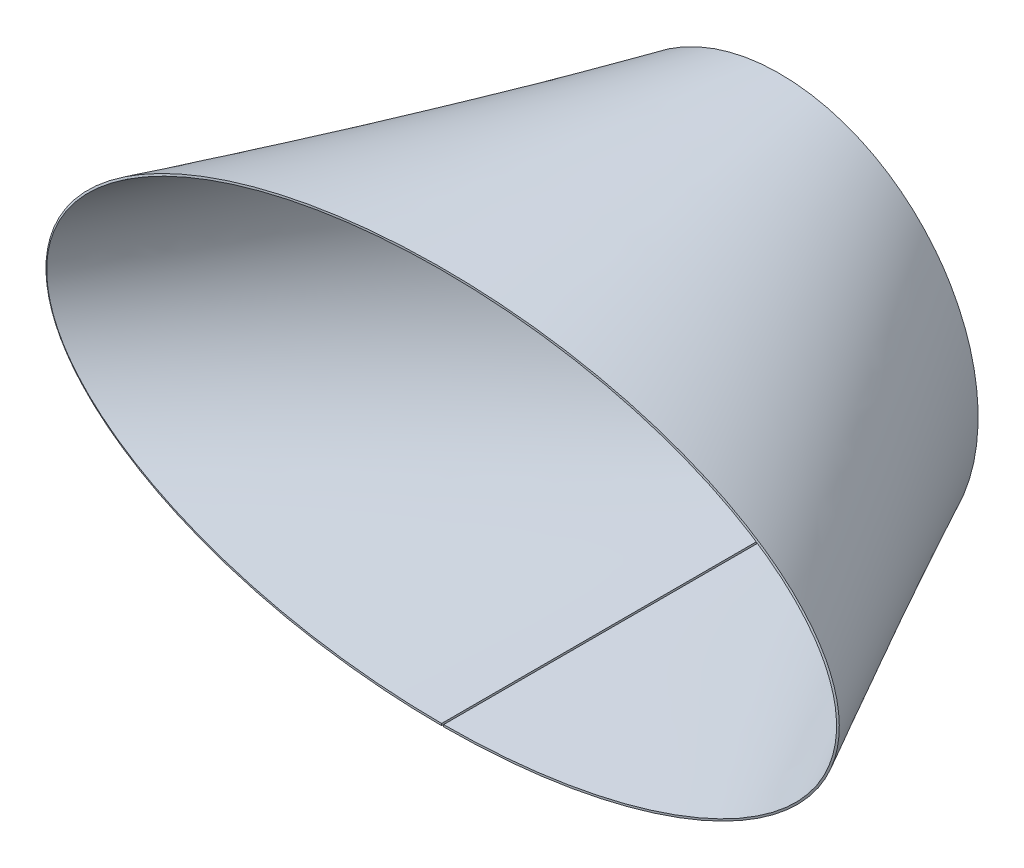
ISO-10303-21;
HEADER;
FILE_DESCRIPTION(('STEP AP214'),'2;1');
FILE_NAME('part.step','',(''),(''),'','','');
FILE_SCHEMA(('AUTOMOTIVE_DESIGN { 1 0 10303 214 1 1 1 1 }'));
ENDSEC;
DATA;
#1=APPLICATION_CONTEXT('core data for automotive mechanical design processes');
#2=APPLICATION_PROTOCOL_DEFINITION('international standard','automotive_design',2000,#1);
#3=PRODUCT_CONTEXT('',#1,'mechanical');
#4=PRODUCT('Part','Part','',(#3));
#5=PRODUCT_RELATED_PRODUCT_CATEGORY('part','',(#4));
#6=PRODUCT_DEFINITION_FORMATION('','',#4);
#7=PRODUCT_DEFINITION_CONTEXT('part definition',#1,'design');
#8=PRODUCT_DEFINITION('design','',#6,#7);
#9=PRODUCT_DEFINITION_SHAPE('','',#8);
#10=(LENGTH_UNIT() NAMED_UNIT(*) SI_UNIT(.MILLI.,.METRE.));
#11=(NAMED_UNIT(*) PLANE_ANGLE_UNIT() SI_UNIT($,.RADIAN.));
#12=(NAMED_UNIT(*) SI_UNIT($,.STERADIAN.) SOLID_ANGLE_UNIT());
#13=UNCERTAINTY_MEASURE_WITH_UNIT(LENGTH_MEASURE(1.E-05),#10,'distance_accuracy_value','');
#14=(GEOMETRIC_REPRESENTATION_CONTEXT(3) GLOBAL_UNCERTAINTY_ASSIGNED_CONTEXT((#13)) GLOBAL_UNIT_ASSIGNED_CONTEXT((#10,
#11,#12)) REPRESENTATION_CONTEXT('',''));
#15=CARTESIAN_POINT('',(0.,0.,0.));
#16=DIRECTION('',(0.,0.,1.));
#17=DIRECTION('',(1.,0.,0.));
#18=AXIS2_PLACEMENT_3D('',#15,#16,#17);
#19=CARTESIAN_POINT('',(-0.498749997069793,-98.9996882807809,170.000005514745));
#20=CARTESIAN_POINT('',(-26.9317324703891,-98.9666469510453,170.00029754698));
#21=CARTESIAN_POINT('',(-52.8117977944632,-96.3101610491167,170.015810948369));
#22=CARTESIAN_POINT('',(-100.661697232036,-86.3416478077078,170.076908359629));
#23=CARTESIAN_POINT('',(-122.630835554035,-79.0289560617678,170.123113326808));
#24=CARTESIAN_POINT('',(-150.552654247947,-65.034755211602,170.21455489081));
#25=CARTESIAN_POINT('',(-158.831209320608,-59.9615917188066,170.248140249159));
#26=CARTESIAN_POINT('',(-173.190086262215,-49.1802625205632,170.317705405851));
#27=CARTESIAN_POINT('',(-179.270324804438,-43.4722828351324,170.353743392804));
#28=CARTESIAN_POINT('',(-189.096768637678,-31.6020775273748,170.420404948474));
#29=CARTESIAN_POINT('',(-192.843094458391,-25.440235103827,170.450919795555));
#30=CARTESIAN_POINT('',(-197.871596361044,-12.8331639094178,170.494529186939));
#31=CARTESIAN_POINT('',(-199.154298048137,-6.38790992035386,170.507205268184));
#32=CARTESIAN_POINT('',(-199.121524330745,6.63360044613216,170.506831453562));
#33=CARTESIAN_POINT('',(-197.806379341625,13.0773798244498,170.493788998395));
#34=CARTESIAN_POINT('',(-192.714381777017,25.6785907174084,170.449612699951));
#35=CARTESIAN_POINT('',(-188.937004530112,31.836037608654,170.418896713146));
#36=CARTESIAN_POINT('',(-179.050734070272,43.6945146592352,170.352000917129));
#37=CARTESIAN_POINT('',(-172.941724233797,49.3951610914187,170.315926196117));
#38=CARTESIAN_POINT('',(-158.528526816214,60.1589897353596,170.24639069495));
#39=CARTESIAN_POINT('',(-150.224423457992,65.2219880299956,170.212870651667));
#40=CARTESIAN_POINT('',(-122.232178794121,79.181713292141,170.121703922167));
#41=CARTESIAN_POINT('',(-100.226304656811,86.4670619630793,170.075770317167));
#42=CARTESIAN_POINT('',(-52.3264036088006,96.3758730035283,170.015225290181));
#43=CARTESIAN_POINT('',(-26.4330812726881,99.,170.));
#44=CARTESIAN_POINT('',(26.433081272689,98.9999999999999,170.));
#45=CARTESIAN_POINT('',(52.3264036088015,96.3758730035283,170.015225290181));
#46=CARTESIAN_POINT('',(100.226304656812,86.4670619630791,170.075770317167));
#47=CARTESIAN_POINT('',(122.232178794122,79.1817132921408,170.121703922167));
#48=CARTESIAN_POINT('',(150.224423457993,65.2219880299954,170.212870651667));
#49=CARTESIAN_POINT('',(158.528526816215,60.1589897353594,170.246390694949));
#50=CARTESIAN_POINT('',(172.941724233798,49.3951610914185,170.315926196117));
#51=CARTESIAN_POINT('',(179.050734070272,43.6945146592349,170.352000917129));
#52=CARTESIAN_POINT('',(188.937004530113,31.8360376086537,170.418896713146));
#53=CARTESIAN_POINT('',(192.714381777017,25.6785907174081,170.449612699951));
#54=CARTESIAN_POINT('',(197.806379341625,13.0773798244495,170.493788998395));
#55=CARTESIAN_POINT('',(199.121524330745,6.6336004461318,170.506831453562));
#56=CARTESIAN_POINT('',(199.154298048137,-6.3879099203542,170.507205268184));
#57=CARTESIAN_POINT('',(197.871596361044,-12.8331639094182,170.494529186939));
#58=CARTESIAN_POINT('',(192.843094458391,-25.4402351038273,170.450919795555));
#59=CARTESIAN_POINT('',(189.096768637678,-31.6020775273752,170.420404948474));
#60=CARTESIAN_POINT('',(179.270324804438,-43.4722828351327,170.353743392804));
#61=CARTESIAN_POINT('',(173.190086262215,-49.1802625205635,170.317705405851));
#62=CARTESIAN_POINT('',(158.831209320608,-59.9615917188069,170.248140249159));
#63=CARTESIAN_POINT('',(150.552654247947,-65.0347552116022,170.21455489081));
#64=CARTESIAN_POINT('',(122.630835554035,-79.028956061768,170.123113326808));
#65=CARTESIAN_POINT('',(100.661697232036,-86.3416478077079,170.076908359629));
#66=CARTESIAN_POINT('',(52.8117977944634,-96.3101610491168,170.015810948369));
#67=CARTESIAN_POINT('',(26.9317324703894,-98.9666469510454,170.00029754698));
#68=CARTESIAN_POINT('',(0.498749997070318,-98.9996882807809,170.000005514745));
#69=CARTESIAN_POINT('',(-0.499999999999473,-99.9996874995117,170.));
#70=CARTESIAN_POINT('',(-26.9991579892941,-99.9665634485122,170.));
#71=CARTESIAN_POINT('',(-52.9444129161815,-97.304357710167,170.));
#72=CARTESIAN_POINT('',(-100.936657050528,-87.3032849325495,170.));
#73=CARTESIAN_POINT('',(-122.983646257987,-79.9644178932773,170.));
#74=CARTESIAN_POINT('',(-151.037586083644,-65.8847479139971,170.));
#75=CARTESIAN_POINT('',(-159.361981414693,-60.7754017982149,170.));
#76=CARTESIAN_POINT('',(-173.812869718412,-49.8991390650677,170.));
#77=CARTESIAN_POINT('',(-179.939362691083,-44.1322224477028,170.));
#78=CARTESIAN_POINT('',(-189.85037980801,-32.1154937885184,170.));
#79=CARTESIAN_POINT('',(-193.634903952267,-25.8656817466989,170.));
#80=CARTESIAN_POINT('',(-198.717916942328,-13.0578373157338,170.));
#81=CARTESIAN_POINT('',(-200.016405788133,-6.49980492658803,170.));
#82=CARTESIAN_POINT('',(-199.983281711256,6.74980512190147,170.));
#83=CARTESIAN_POINT('',(-198.652006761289,13.3061939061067,170.));
#84=CARTESIAN_POINT('',(-193.504970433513,26.1076445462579,170.));
#85=CARTESIAN_POINT('',(-189.689209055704,32.3527064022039,170.));
#86=CARTESIAN_POINT('',(-179.718139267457,44.3570087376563,170.));
#87=CARTESIAN_POINT('',(-173.56283085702,50.1162492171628,170.));
#88=CARTESIAN_POINT('',(-159.057606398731,60.9744143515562,170.));
#89=CARTESIAN_POINT('',(-150.70769035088,66.073339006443,170.));
#90=CARTESIAN_POINT('',(-122.583439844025,80.1178975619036,170.));
#91=CARTESIAN_POINT('',(-100.499825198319,87.4291829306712,170.));
#92=CARTESIAN_POINT('',(-52.4577256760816,97.3702341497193,170.));
#93=CARTESIAN_POINT('',(-26.4992407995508,100.,170.));
#94=CARTESIAN_POINT('',(26.4992407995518,99.9999999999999,170.));
#95=CARTESIAN_POINT('',(52.4577256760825,97.3702341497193,170.));
#96=CARTESIAN_POINT('',(100.49982519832,87.429182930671,170.));
#97=CARTESIAN_POINT('',(122.583439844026,80.1178975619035,170.));
#98=CARTESIAN_POINT('',(150.707690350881,66.0733390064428,170.));
#99=CARTESIAN_POINT('',(159.057606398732,60.9744143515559,170.));
#100=CARTESIAN_POINT('',(173.562830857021,50.1162492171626,170.));
#101=CARTESIAN_POINT('',(179.718139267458,44.357008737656,170.));
#102=CARTESIAN_POINT('',(189.689209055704,32.3527064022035,170.));
#103=CARTESIAN_POINT('',(193.504970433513,26.1076445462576,170.));
#104=CARTESIAN_POINT('',(198.652006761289,13.3061939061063,170.));
#105=CARTESIAN_POINT('',(199.983281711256,6.74980512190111,170.));
#106=CARTESIAN_POINT('',(200.016405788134,-6.49980492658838,170.));
#107=CARTESIAN_POINT('',(198.717916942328,-13.0578373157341,170.));
#108=CARTESIAN_POINT('',(193.634903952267,-25.8656817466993,170.));
#109=CARTESIAN_POINT('',(189.85037980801,-32.1154937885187,170.));
#110=CARTESIAN_POINT('',(179.939362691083,-44.1322224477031,170.));
#111=CARTESIAN_POINT('',(173.812869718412,-49.899139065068,170.));
#112=CARTESIAN_POINT('',(159.361981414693,-60.7754017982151,170.));
#113=CARTESIAN_POINT('',(151.037586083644,-65.8847479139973,170.));
#114=CARTESIAN_POINT('',(122.983646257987,-79.9644178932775,170.));
#115=CARTESIAN_POINT('',(100.936657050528,-87.3032849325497,170.));
#116=CARTESIAN_POINT('',(52.9444129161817,-97.3043577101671,170.));
#117=CARTESIAN_POINT('',(26.9991579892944,-99.9665634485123,170.));
#118=CARTESIAN_POINT('',(0.499999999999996,-99.9996874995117,170.));
#119=B_SPLINE_SURFACE_WITH_KNOTS('',1,3,((#19,#20,#21,#22,#23,#24,#25,#26,#27,#28,#29,#30,#31,
#32,#33,#34,#35,#36,#37,#38,#39,#40,#41,#42,#43,#44,#45,#46,#47,#48,#49,#50,#51,#52,#53,#54,#55,
#56,#57,#58,#59,#60,#61,#62,#63,#64,#65,#66,#67,#68),(#69,#70,#71,#72,#73,#74,#75,#76,#77,#78,
#79,#80,#81,#82,#83,#84,#85,#86,#87,#88,#89,#90,#91,#92,#93,#94,#95,#96,#97,#98,#99,#100,#101,
#102,#103,#104,#105,#106,#107,#108,#109,#110,#111,#112,#113,#114,#115,#116,#117,#118)),
.UNSPECIFIED.,.F.,.F.,.F.,(2,2),(4,2,2,2,2,2,2,2,2,2,2,2,2,2,2,2,2,2,2,2,2,2,2,2,4),(0.,1.),(0.,
0.0625,0.125,0.15625,0.1875,0.21875,0.25,0.28125,0.3125,0.34375,0.375,0.4375,0.5,0.5625,0.625,
0.65625,0.6875,0.71875,0.75,0.78125,0.8125,0.84375,0.875,0.9375,1.),.UNSPECIFIED.);
#120=CARTESIAN_POINT('',(0.499999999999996,-99.9996874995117,170.));
#121=CARTESIAN_POINT('',(0.498749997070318,-98.9996882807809,170.000005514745));
#122=B_SPLINE_CURVE_WITH_KNOTS('',1,(#120,#121),.UNSPECIFIED.,.F.,.F.,(2,2),(0.,1.),.UNSPECIFIED.);
#123=CARTESIAN_POINT('',(0.499999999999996,-99.9996874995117,170.));
#124=VERTEX_POINT('',#123);
#125=CARTESIAN_POINT('',(0.498749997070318,-98.9996882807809,170.000005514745));
#126=VERTEX_POINT('',#125);
#127=EDGE_CURVE('E14',#124,#126,#122,.T.);
#128=CARTESIAN_POINT('',(0.499999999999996,-99.9996874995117,170.));
#129=CARTESIAN_POINT('',(26.9991579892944,-99.9665634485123,170.));
#130=CARTESIAN_POINT('',(52.9444129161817,-97.3043577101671,170.));
#131=CARTESIAN_POINT('',(100.936657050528,-87.3032849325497,170.));
#132=CARTESIAN_POINT('',(122.983646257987,-79.9644178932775,170.));
#133=CARTESIAN_POINT('',(151.037586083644,-65.8847479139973,170.));
#134=CARTESIAN_POINT('',(159.361981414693,-60.7754017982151,170.));
#135=CARTESIAN_POINT('',(173.812869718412,-49.899139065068,170.));
#136=CARTESIAN_POINT('',(179.939362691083,-44.1322224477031,170.));
#137=CARTESIAN_POINT('',(189.85037980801,-32.1154937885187,170.));
#138=CARTESIAN_POINT('',(193.634903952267,-25.8656817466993,170.));
#139=CARTESIAN_POINT('',(198.717916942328,-13.0578373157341,170.));
#140=CARTESIAN_POINT('',(200.016405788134,-6.49980492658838,170.));
#141=CARTESIAN_POINT('',(199.983281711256,6.74980512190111,170.));
#142=CARTESIAN_POINT('',(198.652006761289,13.3061939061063,170.));
#143=CARTESIAN_POINT('',(193.504970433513,26.1076445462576,170.));
#144=CARTESIAN_POINT('',(189.689209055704,32.3527064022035,170.));
#145=CARTESIAN_POINT('',(179.718139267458,44.357008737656,170.));
#146=CARTESIAN_POINT('',(173.562830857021,50.1162492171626,170.));
#147=CARTESIAN_POINT('',(159.057606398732,60.9744143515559,170.));
#148=CARTESIAN_POINT('',(150.707690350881,66.0733390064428,170.));
#149=CARTESIAN_POINT('',(122.583439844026,80.1178975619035,170.));
#150=CARTESIAN_POINT('',(100.49982519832,87.429182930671,170.));
#151=CARTESIAN_POINT('',(52.4577256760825,97.3702341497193,170.));
#152=CARTESIAN_POINT('',(26.4992407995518,99.9999999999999,170.));
#153=CARTESIAN_POINT('',(-26.4992407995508,100.,170.));
#154=CARTESIAN_POINT('',(-52.4577256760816,97.3702341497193,170.));
#155=CARTESIAN_POINT('',(-100.499825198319,87.4291829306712,170.));
#156=CARTESIAN_POINT('',(-122.583439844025,80.1178975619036,170.));
#157=CARTESIAN_POINT('',(-150.70769035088,66.073339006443,170.));
#158=CARTESIAN_POINT('',(-159.057606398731,60.9744143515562,170.));
#159=CARTESIAN_POINT('',(-173.56283085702,50.1162492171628,170.));
#160=CARTESIAN_POINT('',(-179.718139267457,44.3570087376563,170.));
#161=CARTESIAN_POINT('',(-189.689209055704,32.3527064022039,170.));
#162=CARTESIAN_POINT('',(-193.504970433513,26.1076445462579,170.));
#163=CARTESIAN_POINT('',(-198.652006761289,13.3061939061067,170.));
#164=CARTESIAN_POINT('',(-199.983281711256,6.74980512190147,170.));
#165=CARTESIAN_POINT('',(-200.016405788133,-6.49980492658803,170.));
#166=CARTESIAN_POINT('',(-198.717916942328,-13.0578373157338,170.));
#167=CARTESIAN_POINT('',(-193.634903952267,-25.8656817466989,170.));
#168=CARTESIAN_POINT('',(-189.85037980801,-32.1154937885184,170.));
#169=CARTESIAN_POINT('',(-179.939362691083,-44.1322224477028,170.));
#170=CARTESIAN_POINT('',(-173.812869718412,-49.8991390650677,170.));
#171=CARTESIAN_POINT('',(-159.361981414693,-60.7754017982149,170.));
#172=CARTESIAN_POINT('',(-151.037586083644,-65.8847479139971,170.));
#173=CARTESIAN_POINT('',(-122.983646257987,-79.9644178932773,170.));
#174=CARTESIAN_POINT('',(-100.936657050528,-87.3032849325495,170.));
#175=CARTESIAN_POINT('',(-52.9444129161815,-97.304357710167,170.));
#176=CARTESIAN_POINT('',(-26.9991579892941,-99.9665634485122,170.));
#177=CARTESIAN_POINT('',(-0.499999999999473,-99.9996874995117,170.));
#178=B_SPLINE_CURVE_WITH_KNOTS('',3,(#128,#129,#130,#131,#132,#133,#134,#135,#136,#137,#138,
#139,#140,#141,#142,#143,#144,#145,#146,#147,#148,#149,#150,#151,#152,#153,#154,#155,#156,#157,
#158,#159,#160,#161,#162,#163,#164,#165,#166,#167,#168,#169,#170,#171,#172,#173,#174,#175,#176,
#177),.UNSPECIFIED.,.F.,.F.,(4,2,2,2,2,2,2,2,2,2,2,2,2,2,2,2,2,2,2,2,2,2,2,2,4),(0.,0.0625,
0.125,0.15625,0.1875,0.21875,0.25,0.28125,0.3125,0.34375,0.375,0.4375,0.5,0.5625,0.625,0.65625,
0.6875,0.71875,0.75,0.78125,0.8125,0.84375,0.875,0.9375,1.),.UNSPECIFIED.);
#179=CARTESIAN_POINT('',(-0.499999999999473,-99.9996874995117,170.));
#180=VERTEX_POINT('',#179);
#181=EDGE_CURVE('E238',#124,#180,#178,.T.);
#182=CARTESIAN_POINT('',(-0.499999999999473,-99.9996874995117,170.));
#183=CARTESIAN_POINT('',(-0.498749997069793,-98.9996882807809,170.000005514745));
#184=B_SPLINE_CURVE_WITH_KNOTS('',1,(#182,#183),.UNSPECIFIED.,.F.,.F.,(2,2),(0.,1.),.UNSPECIFIED.);
#185=CARTESIAN_POINT('',(-0.498749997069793,-98.9996882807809,170.000005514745));
#186=VERTEX_POINT('',#185);
#187=EDGE_CURVE('E71',#180,#186,#184,.T.);
#188=CARTESIAN_POINT('',(0.49874999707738,-98.9996882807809,170.000005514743));
#189=CARTESIAN_POINT('',(3.79380001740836,-98.9955178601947,170.000042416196));
#190=CARTESIAN_POINT('',(7.08866580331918,-98.9506932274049,170.000318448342));
#191=CARTESIAN_POINT('',(13.655621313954,-98.779713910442,170.001350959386));
#192=CARTESIAN_POINT('',(16.9277243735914,-98.6540706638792,170.002104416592));
#193=CARTESIAN_POINT('',(26.6618859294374,-98.1589365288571,170.005066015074));
#194=CARTESIAN_POINT('',(33.1183613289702,-97.6711360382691,170.007976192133));
#195=CARTESIAN_POINT('',(45.8739729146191,-96.3807917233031,170.01570302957));
#196=CARTESIAN_POINT('',(52.1737422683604,-95.5844987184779,170.020481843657));
#197=CARTESIAN_POINT('',(64.5719662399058,-93.6848868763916,170.031962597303));
#198=CARTESIAN_POINT('',(70.6716169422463,-92.5894184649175,170.038615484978));
#199=CARTESIAN_POINT('',(82.6257643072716,-90.099079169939,170.053878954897));
#200=CARTESIAN_POINT('',(88.4822365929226,-88.7138257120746,170.062427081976));
#201=CARTESIAN_POINT('',(97.1242135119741,-86.3968320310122,170.076874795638));
#202=CARTESIAN_POINT('',(99.9453473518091,-85.5965126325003,170.081886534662));
#203=CARTESIAN_POINT('',(105.509766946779,-83.9251812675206,170.092404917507));
#204=CARTESIAN_POINT('',(108.25352642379,-83.0557545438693,170.097900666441));
#205=CARTESIAN_POINT('',(113.657558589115,-81.247339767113,170.109387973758));
#206=CARTESIAN_POINT('',(116.318407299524,-80.3100754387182,170.115367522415));
#207=CARTESIAN_POINT('',(121.551074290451,-78.3670441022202,170.127820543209));
#208=CARTESIAN_POINT('',(124.12358503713,-77.3631464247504,170.134280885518));
#209=CARTESIAN_POINT('',(129.173995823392,-75.2879318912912,170.147689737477));
#210=CARTESIAN_POINT('',(131.652723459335,-74.2186338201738,170.154624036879));
#211=CARTESIAN_POINT('',(136.509984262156,-72.0137006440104,170.168965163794));
#212=CARTESIAN_POINT('',(138.889500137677,-70.8802357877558,170.176356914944));
#213=CARTESIAN_POINT('',(143.531173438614,-68.5538699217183,170.191562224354));
#214=CARTESIAN_POINT('',(145.794716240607,-67.3637404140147,170.199356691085));
#215=CARTESIAN_POINT('',(150.189319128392,-64.9319286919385,170.215301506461));
#216=CARTESIAN_POINT('',(152.322226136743,-63.6935935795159,170.223429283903));
#217=CARTESIAN_POINT('',(156.453123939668,-61.1681230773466,170.239984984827));
#218=CARTESIAN_POINT('',(158.453199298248,-59.8844072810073,170.248391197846));
#219=CARTESIAN_POINT('',(162.316011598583,-57.2709308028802,170.265438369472));
#220=CARTESIAN_POINT('',(164.181090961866,-55.9446441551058,170.274059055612));
#221=CARTESIAN_POINT('',(167.771426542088,-53.2488518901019,170.291453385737));
#222=CARTESIAN_POINT('',(169.499303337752,-51.8828453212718,170.300209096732));
#223=CARTESIAN_POINT('',(172.812961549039,-49.1102846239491,170.317776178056));
#224=CARTESIAN_POINT('',(174.401645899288,-47.7072224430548,170.3265728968));
#225=CARTESIAN_POINT('',(176.697660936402,-45.554272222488,170.339844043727));
#226=CARTESIAN_POINT('',(177.438114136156,-44.8395137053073,170.344215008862));
#227=CARTESIAN_POINT('',(178.882953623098,-43.4013920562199,170.35292261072));
#228=CARTESIAN_POINT('',(179.58775774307,-42.6784498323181,170.357258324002));
#229=CARTESIAN_POINT('',(180.960998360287,-41.2243450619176,170.365877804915));
#230=CARTESIAN_POINT('',(181.62986970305,-40.4935934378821,170.370161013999));
#231=CARTESIAN_POINT('',(182.93097293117,-39.0242218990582,170.378656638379));
#232=CARTESIAN_POINT('',(183.563654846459,-38.2860009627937,170.382868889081));
#233=CARTESIAN_POINT('',(184.792103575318,-36.80205194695,170.39120255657));
#234=CARTESIAN_POINT('',(185.388333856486,-36.0567079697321,170.395324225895));
#235=CARTESIAN_POINT('',(186.543608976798,-34.5588721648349,170.403455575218));
#236=CARTESIAN_POINT('',(187.103128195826,-33.8067466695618,170.407465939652));
#237=CARTESIAN_POINT('',(188.184714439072,-32.2957078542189,170.415352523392));
#238=CARTESIAN_POINT('',(188.70726356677,-31.5371400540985,170.419229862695));
#239=CARTESIAN_POINT('',(189.714647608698,-30.0135763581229,170.426827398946));
#240=CARTESIAN_POINT('',(190.199968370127,-29.2489021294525,170.430549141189));
#241=CARTESIAN_POINT('',(191.132638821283,-27.7134848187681,170.437811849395));
#242=CARTESIAN_POINT('',(191.580473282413,-26.9430366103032,170.441354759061));
#243=CARTESIAN_POINT('',(192.437920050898,-25.3964295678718,170.448235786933));
#244=CARTESIAN_POINT('',(192.84801035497,-24.6205361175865,170.451576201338));
#245=CARTESIAN_POINT('',(193.629724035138,-23.0633952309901,170.45802814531));
#246=CARTESIAN_POINT('',(194.001812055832,-22.282381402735,170.461142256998));
#247=CARTESIAN_POINT('',(194.707283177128,-20.7153541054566,170.467117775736));
#248=CARTESIAN_POINT('',(195.041110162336,-19.9295407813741,170.469981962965));
#249=CARTESIAN_POINT('',(195.669828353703,-18.3532657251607,170.47543447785));
#250=CARTESIAN_POINT('',(195.965134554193,-17.5629697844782,170.478025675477));
#251=CARTESIAN_POINT('',(196.516587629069,-15.9780766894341,170.482910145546));
#252=CARTESIAN_POINT('',(196.773111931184,-15.1836110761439,170.485206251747));
#253=CARTESIAN_POINT('',(197.246784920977,-13.5907207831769,170.489480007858));
#254=CARTESIAN_POINT('',(197.464264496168,-12.7923946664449,170.491460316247));
#255=CARTESIAN_POINT('',(197.859638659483,-11.1921194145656,170.495083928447));
#256=CARTESIAN_POINT('',(198.037808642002,-10.3902384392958,170.496729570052));
#257=CARTESIAN_POINT('',(198.354360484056,-8.78318237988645,170.499667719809));
#258=CARTESIAN_POINT('',(198.49295368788,-7.97804900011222,170.500962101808));
#259=CARTESIAN_POINT('',(198.730154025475,-6.36480895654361,170.503184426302));
#260=CARTESIAN_POINT('',(198.82890070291,-5.55672284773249,170.504113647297));
#261=CARTESIAN_POINT('',(198.986213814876,-3.93788929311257,170.505595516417));
#262=CARTESIAN_POINT('',(199.044841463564,-3.12714780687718,170.506148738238));
#263=CARTESIAN_POINT('',(199.121724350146,-1.50330611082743,170.506871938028));
#264=CARTESIAN_POINT('',(199.139957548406,-0.690204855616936,170.507041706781));
#265=CARTESIAN_POINT('',(199.135864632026,0.935974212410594,170.506995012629));
#266=CARTESIAN_POINT('',(199.113534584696,1.749052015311,170.506778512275));
#267=CARTESIAN_POINT('',(199.028477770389,3.3728003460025,170.505962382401));
#268=CARTESIAN_POINT('',(198.965765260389,4.18347162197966,170.505362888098));
#269=CARTESIAN_POINT('',(198.800303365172,5.80211934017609,170.503789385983));
#270=CARTESIAN_POINT('',(198.697485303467,6.61008874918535,170.502814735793));
#271=CARTESIAN_POINT('',(198.452164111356,8.22305089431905,170.500502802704));
#272=CARTESIAN_POINT('',(198.309514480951,9.02802130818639,170.49916418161));
#273=CARTESIAN_POINT('',(197.984872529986,10.634707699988,170.496139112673));
#274=CARTESIAN_POINT('',(197.802662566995,11.4363796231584,170.494450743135));
#275=CARTESIAN_POINT('',(197.399231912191,13.036193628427,170.490743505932));
#276=CARTESIAN_POINT('',(197.17773029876,13.8342647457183,170.488722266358));
#277=CARTESIAN_POINT('',(196.696037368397,15.4266023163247,170.484368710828));
#278=CARTESIAN_POINT('',(196.435510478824,16.2207670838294,170.482033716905));
#279=CARTESIAN_POINT('',(195.876077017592,17.8050160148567,170.477073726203));
#280=CARTESIAN_POINT('',(195.576789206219,18.5949653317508,170.474445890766));
#281=CARTESIAN_POINT('',(194.940133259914,20.1705047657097,170.46892250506));
#282=CARTESIAN_POINT('',(194.602347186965,20.9559257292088,170.466024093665));
#283=CARTESIAN_POINT('',(193.88898409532,22.5221258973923,170.459982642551));
#284=CARTESIAN_POINT('',(193.512961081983,23.30270164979,170.456836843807));
#285=CARTESIAN_POINT('',(192.723404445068,24.8589238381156,170.450324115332));
#286=CARTESIAN_POINT('',(192.30940484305,25.6343335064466,170.446954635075));
#287=CARTESIAN_POINT('',(191.444167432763,27.179930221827,170.440018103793));
#288=CARTESIAN_POINT('',(190.992450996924,27.9498489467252,170.436448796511));
#289=CARTESIAN_POINT('',(190.052045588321,29.4841642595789,170.429135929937));
#290=CARTESIAN_POINT('',(189.562871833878,30.2482633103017,170.425390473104));
#291=CARTESIAN_POINT('',(188.547811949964,31.7706333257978,170.417748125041));
#292=CARTESIAN_POINT('',(188.021440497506,32.5285802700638,170.413849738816));
#293=CARTESIAN_POINT('',(186.932241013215,34.0383337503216,170.405923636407));
#294=CARTESIAN_POINT('',(186.36893185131,34.7897927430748,170.401894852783));
#295=CARTESIAN_POINT('',(185.206109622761,36.2862516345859,170.393729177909));
#296=CARTESIAN_POINT('',(184.606123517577,37.0308835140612,170.38959165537));
#297=CARTESIAN_POINT('',(183.370197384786,38.513364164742,170.381228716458));
#298=CARTESIAN_POINT('',(182.73379552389,39.2508274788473,170.377003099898));
#299=CARTESIAN_POINT('',(181.42528819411,40.7186393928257,170.368483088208));
#300=CARTESIAN_POINT('',(180.752734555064,41.4485879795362,170.364188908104));
#301=CARTESIAN_POINT('',(179.372166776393,42.9010420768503,170.355549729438));
#302=CARTESIAN_POINT('',(178.663719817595,43.6231359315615,170.351205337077));
#303=CARTESIAN_POINT('',(177.211633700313,45.0595162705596,170.342482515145));
#304=CARTESIAN_POINT('',(176.467578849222,45.773381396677,170.338105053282));
#305=CARTESIAN_POINT('',(174.160730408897,47.9235436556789,170.324817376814));
#306=CARTESIAN_POINT('',(172.564982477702,49.3246786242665,170.316014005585));
#307=CARTESIAN_POINT('',(169.23736548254,52.0932076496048,170.2984406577));
#308=CARTESIAN_POINT('',(167.502611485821,53.4571117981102,170.28968558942));
#309=CARTESIAN_POINT('',(163.898704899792,56.1485196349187,170.272298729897));
#310=CARTESIAN_POINT('',(162.026949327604,57.4725289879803,170.263685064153));
#311=CARTESIAN_POINT('',(158.150983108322,60.0812716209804,170.246657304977));
#312=CARTESIAN_POINT('',(156.144446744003,61.3625376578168,170.238263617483));
#313=CARTESIAN_POINT('',(152.000840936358,63.8829300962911,170.221737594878));
#314=CARTESIAN_POINT('',(149.861702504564,65.1186451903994,170.213627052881));
#315=CARTESIAN_POINT('',(145.454866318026,67.5450398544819,170.19772066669));
#316=CARTESIAN_POINT('',(143.185335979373,68.7323816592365,170.189947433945));
#317=CARTESIAN_POINT('',(138.531962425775,71.0530127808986,170.174787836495));
#318=CARTESIAN_POINT('',(136.146745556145,72.1835403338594,170.16742056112));
#319=CARTESIAN_POINT('',(131.278397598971,74.3824605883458,170.153130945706));
#320=CARTESIAN_POINT('',(128.794293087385,75.4486927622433,170.146223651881));
#321=CARTESIAN_POINT('',(123.733450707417,77.5176442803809,170.132870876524));
#322=CARTESIAN_POINT('',(121.155893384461,78.5183545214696,170.126439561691));
#323=CARTESIAN_POINT('',(115.913462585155,80.4548870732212,170.114046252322));
#324=CARTESIAN_POINT('',(113.247903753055,81.3888495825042,170.108097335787));
#325=CARTESIAN_POINT('',(107.834787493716,83.1905441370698,170.096672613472));
#326=CARTESIAN_POINT('',(105.086660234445,84.0565617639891,170.09120876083));
#327=CARTESIAN_POINT('',(99.513848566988,85.7209660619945,170.080755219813));
#328=CARTESIAN_POINT('',(96.6886958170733,86.5177765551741,170.075776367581));
#329=CARTESIAN_POINT('',(88.0355083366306,88.8238897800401,170.061430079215));
#330=CARTESIAN_POINT('',(82.1720803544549,90.201874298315,170.052949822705));
#331=CARTESIAN_POINT('',(70.2054708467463,92.6772937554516,170.037824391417));
#332=CARTESIAN_POINT('',(64.1003417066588,93.765177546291,170.031241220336));
#333=CARTESIAN_POINT('',(51.6925748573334,95.6493077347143,170.019901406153));
#334=CARTESIAN_POINT('',(45.3887594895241,96.4377672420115,170.015193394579));
#335=CARTESIAN_POINT('',(32.6268750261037,97.7121529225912,170.007609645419));
#336=CARTESIAN_POINT('',(26.1681924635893,98.1918891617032,170.004771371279));
#337=CARTESIAN_POINT('',(13.139828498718,98.8381730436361,170.000952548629));
#338=CARTESIAN_POINT('',(6.56991424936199,98.9999999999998,169.999999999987));
#339=CARTESIAN_POINT('',(-6.56991424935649,99.0000000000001,170.000000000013));
#340=CARTESIAN_POINT('',(-13.1398284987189,98.8381730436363,170.000952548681));
#341=CARTESIAN_POINT('',(-26.1681924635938,98.1918891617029,170.004771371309));
#342=CARTESIAN_POINT('',(-32.6268750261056,97.7121529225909,170.0076096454));
#343=CARTESIAN_POINT('',(-45.3887594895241,96.4377672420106,170.015193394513));
#344=CARTESIAN_POINT('',(-51.6925748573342,95.6493077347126,170.019901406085));
#345=CARTESIAN_POINT('',(-64.1003417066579,93.7651775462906,170.031241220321));
#346=CARTESIAN_POINT('',(-70.2054708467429,92.6772937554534,170.037824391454));
#347=CARTESIAN_POINT('',(-82.1720803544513,90.2018742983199,170.052949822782));
#348=CARTESIAN_POINT('',(-88.0355083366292,88.8238897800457,170.061430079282));
#349=CARTESIAN_POINT('',(-96.6886958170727,86.5177765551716,170.075776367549));
#350=CARTESIAN_POINT('',(-99.5138485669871,85.720966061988,170.080755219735));
#351=CARTESIAN_POINT('',(-105.086660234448,84.0565617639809,170.091208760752));
#352=CARTESIAN_POINT('',(-107.834787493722,83.1905441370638,170.096672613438));
#353=CARTESIAN_POINT('',(-113.247903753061,81.3888495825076,170.108097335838));
#354=CARTESIAN_POINT('',(-115.913462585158,80.4548870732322,170.114046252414));
#355=CARTESIAN_POINT('',(-121.155893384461,78.5183545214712,170.126439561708));
#356=CARTESIAN_POINT('',(-123.733450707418,77.5176442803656,170.132870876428));
#357=CARTESIAN_POINT('',(-128.794293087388,75.4486927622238,170.146223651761));
#358=CARTESIAN_POINT('',(-131.278397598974,74.3824605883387,170.15313094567));
#359=CARTESIAN_POINT('',(-136.14674555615,72.1835403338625,170.167420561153));
#360=CARTESIAN_POINT('',(-138.53196242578,71.0530127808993,170.174787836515));
#361=CARTESIAN_POINT('',(-143.185335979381,68.7323816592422,170.189947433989));
#362=CARTESIAN_POINT('',(-145.454866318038,67.5450398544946,170.197720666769));
#363=CARTESIAN_POINT('',(-149.861702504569,65.1186451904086,170.213627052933));
#364=CARTESIAN_POINT('',(-152.000840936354,63.8829300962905,170.221737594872));
#365=CARTESIAN_POINT('',(-156.144446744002,61.3625376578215,170.238263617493));
#366=CARTESIAN_POINT('',(-158.150983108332,60.081271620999,170.246657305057));
#367=CARTESIAN_POINT('',(-162.026949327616,57.4725289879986,170.263685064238));
#368=CARTESIAN_POINT('',(-163.898704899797,56.1485196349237,170.27229872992));
#369=CARTESIAN_POINT('',(-167.50261148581,53.4571117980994,170.289685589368));
#370=CARTESIAN_POINT('',(-169.237365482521,52.0932076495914,170.298440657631));
#371=CARTESIAN_POINT('',(-172.564982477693,49.3246786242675,170.316014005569));
#372=CARTESIAN_POINT('',(-174.160730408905,47.9235436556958,170.324817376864));
#373=CARTESIAN_POINT('',(-176.467578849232,45.7733813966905,170.338105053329));
#374=CARTESIAN_POINT('',(-177.211633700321,45.0595162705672,170.342482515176));
#375=CARTESIAN_POINT('',(-178.663719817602,43.6231359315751,170.351205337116));
#376=CARTESIAN_POINT('',(-179.372166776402,42.9010420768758,170.3555497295));
#377=CARTESIAN_POINT('',(-180.752734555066,41.4485879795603,170.36418890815));
#378=CARTESIAN_POINT('',(-181.425288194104,40.7186393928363,170.368483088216));
#379=CARTESIAN_POINT('',(-182.733795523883,39.2508274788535,170.377003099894));
#380=CARTESIAN_POINT('',(-183.370197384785,38.5133641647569,170.38122871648));
#381=CARTESIAN_POINT('',(-184.60612351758,37.0308835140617,170.389591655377));
#382=CARTESIAN_POINT('',(-185.206109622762,36.2862516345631,170.393729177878));
#383=CARTESIAN_POINT('',(-186.368931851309,34.7897927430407,170.401894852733));
#384=CARTESIAN_POINT('',(-186.932241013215,34.0383337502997,170.405923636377));
#385=CARTESIAN_POINT('',(-188.021440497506,32.528580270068,170.413849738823));
#386=CARTESIAN_POINT('',(-188.547811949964,31.7706333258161,170.417748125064));
#387=CARTESIAN_POINT('',(-189.5628718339,30.2482633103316,170.425390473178));
#388=CARTESIAN_POINT('',(-190.052045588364,29.4841642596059,170.429135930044));
#389=CARTESIAN_POINT('',(-190.992450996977,27.9498489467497,170.436448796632));
#390=CARTESIAN_POINT('',(-191.444167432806,27.1799302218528,170.440018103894));
#391=CARTESIAN_POINT('',(-192.309404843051,25.6343335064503,170.44695463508));
#392=CARTESIAN_POINT('',(-192.723404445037,24.8589238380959,170.450324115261));
#393=CARTESIAN_POINT('',(-193.512961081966,23.3027016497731,170.456836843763));
#394=CARTESIAN_POINT('',(-193.888984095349,22.5221258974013,170.459982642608));
#395=CARTESIAN_POINT('',(-194.602347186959,20.955925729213,170.466024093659));
#396=CARTESIAN_POINT('',(-194.940133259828,20.170504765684,170.468922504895));
#397=CARTESIAN_POINT('',(-195.576789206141,18.5949653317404,170.474445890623));
#398=CARTESIAN_POINT('',(-195.8760770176,17.8050160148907,170.477073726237));
#399=CARTESIAN_POINT('',(-196.435510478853,16.2207670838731,170.482033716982));
#400=CARTESIAN_POINT('',(-196.696037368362,15.4266023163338,170.484368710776));
#401=CARTESIAN_POINT('',(-197.177730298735,13.8342647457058,170.488722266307));
#402=CARTESIAN_POINT('',(-197.399231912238,13.036193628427,170.490743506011));
#403=CARTESIAN_POINT('',(-197.802662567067,11.4363796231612,170.494450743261));
#404=CARTESIAN_POINT('',(-197.984872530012,10.6347076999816,170.496139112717));
#405=CARTESIAN_POINT('',(-198.309514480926,9.02802130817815,170.499164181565));
#406=CARTESIAN_POINT('',(-198.452164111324,8.22305089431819,170.500502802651));
#407=CARTESIAN_POINT('',(-198.697485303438,6.61008874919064,170.502814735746));
#408=CARTESIAN_POINT('',(-198.800303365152,5.80211934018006,170.503789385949));
#409=CARTESIAN_POINT('',(-198.965765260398,4.18347162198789,170.505362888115));
#410=CARTESIAN_POINT('',(-199.028477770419,3.37280034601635,170.505962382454));
#411=CARTESIAN_POINT('',(-199.113534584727,1.74905201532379,170.506778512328));
#412=CARTESIAN_POINT('',(-199.135864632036,0.935974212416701,170.506995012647));
#413=CARTESIAN_POINT('',(-199.139957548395,-0.690204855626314,170.507041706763));
#414=CARTESIAN_POINT('',(-199.121724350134,-1.5033061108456,170.506871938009));
#415=CARTESIAN_POINT('',(-199.044841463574,-3.12714780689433,170.506148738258));
#416=CARTESIAN_POINT('',(-198.98621381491,-3.93788929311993,170.505595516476));
#417=CARTESIAN_POINT('',(-198.828900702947,-5.5567228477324,170.504113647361));
#418=CARTESIAN_POINT('',(-198.730154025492,-6.36480895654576,170.503184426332));
#419=CARTESIAN_POINT('',(-198.492953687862,-7.97804900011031,170.500962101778));
#420=CARTESIAN_POINT('',(-198.354360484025,-8.78318237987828,170.499667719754));
#421=CARTESIAN_POINT('',(-198.037808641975,-10.3902384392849,170.496729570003));
#422=CARTESIAN_POINT('',(-197.859638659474,-11.1921194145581,170.49508392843));
#423=CARTESIAN_POINT('',(-197.464264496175,-12.7923946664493,170.491460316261));
#424=CARTESIAN_POINT('',(-197.246784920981,-13.5907207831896,170.489480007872));
#425=CARTESIAN_POINT('',(-196.773111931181,-15.1836110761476,170.485206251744));
#426=CARTESIAN_POINT('',(-196.516587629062,-15.9780766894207,170.482910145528));
#427=CARTESIAN_POINT('',(-195.965134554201,-17.5629697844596,170.478025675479));
#428=CARTESIAN_POINT('',(-195.669828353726,-18.3532657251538,170.475434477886));
#429=CARTESIAN_POINT('',(-195.041110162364,-19.9295407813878,170.469981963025));
#430=CARTESIAN_POINT('',(-194.707283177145,-20.715354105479,170.467117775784));
#431=CARTESIAN_POINT('',(-194.001812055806,-22.2823814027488,170.461142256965));
#432=CARTESIAN_POINT('',(-193.629724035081,-23.0633952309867,170.458028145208));
#433=CARTESIAN_POINT('',(-192.848010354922,-24.6205361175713,170.451576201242));
#434=CARTESIAN_POINT('',(-192.437920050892,-25.3964295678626,170.448235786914));
#435=CARTESIAN_POINT('',(-191.580473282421,-26.9430366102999,170.441354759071));
#436=CARTESIAN_POINT('',(-191.132638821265,-27.7134848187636,170.437811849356));
#437=CARTESIAN_POINT('',(-190.199968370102,-29.2489021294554,170.43054914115));
#438=CARTESIAN_POINT('',(-189.714647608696,-30.0135763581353,170.426827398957));
#439=CARTESIAN_POINT('',(-188.707263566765,-31.5371400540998,170.419229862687));
#440=CARTESIAN_POINT('',(-188.184714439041,-32.295707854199,170.415352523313));
#441=CARTESIAN_POINT('',(-187.103128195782,-33.8067466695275,170.40746593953));
#442=CARTESIAN_POINT('',(-186.543608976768,-34.5588721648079,170.403455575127));
#443=CARTESIAN_POINT('',(-185.388333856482,-36.0567079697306,170.395324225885));
#444=CARTESIAN_POINT('',(-184.792103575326,-36.8020519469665,170.391202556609));
#445=CARTESIAN_POINT('',(-183.563654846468,-38.2860009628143,170.382868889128));
#446=CARTESIAN_POINT('',(-182.930972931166,-39.0242218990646,170.378656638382));
#447=CARTESIAN_POINT('',(-181.62986970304,-40.4935934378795,170.370161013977));
#448=CARTESIAN_POINT('',(-180.960998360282,-41.2243450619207,170.365877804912));
#449=CARTESIAN_POINT('',(-179.587757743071,-42.6784498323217,170.357258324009));
#450=CARTESIAN_POINT('',(-178.882953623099,-43.4013920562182,170.352922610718));
#451=CARTESIAN_POINT('',(-177.438114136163,-44.8395137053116,170.344215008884));
#452=CARTESIAN_POINT('',(-176.697660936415,-45.5542722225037,170.339844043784));
#453=CARTESIAN_POINT('',(-174.401645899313,-47.7072224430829,170.326572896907));
#454=CARTESIAN_POINT('',(-172.812961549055,-49.1102846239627,170.317776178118));
#455=CARTESIAN_POINT('',(-169.499303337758,-51.8828453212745,170.300209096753));
#456=CARTESIAN_POINT('',(-167.771426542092,-53.2488518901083,170.291453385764));
#457=CARTESIAN_POINT('',(-164.181090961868,-55.9446441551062,170.274059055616));
#458=CARTESIAN_POINT('',(-162.316011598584,-57.270930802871,170.265438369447));
#459=CARTESIAN_POINT('',(-158.453199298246,-59.8844072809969,170.24839119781));
#460=CARTESIAN_POINT('',(-156.453123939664,-61.1681230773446,170.239984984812));
#461=CARTESIAN_POINT('',(-152.322226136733,-63.6935935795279,170.223429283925));
#462=CARTESIAN_POINT('',(-150.189319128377,-64.9319286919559,170.215301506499));
#463=CARTESIAN_POINT('',(-145.794716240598,-67.3637404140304,170.199356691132));
#464=CARTESIAN_POINT('',(-143.531173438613,-68.5538699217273,170.191562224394));
#465=CARTESIAN_POINT('',(-138.889500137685,-70.8802357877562,170.176356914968));
#466=CARTESIAN_POINT('',(-136.509984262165,-72.0137006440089,170.16896516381));
#467=CARTESIAN_POINT('',(-131.652723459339,-74.2186338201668,170.154624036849));
#468=CARTESIAN_POINT('',(-129.173995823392,-75.2879318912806,170.14768973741));
#469=CARTESIAN_POINT('',(-124.123585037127,-77.3631464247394,170.134280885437));
#470=CARTESIAN_POINT('',(-121.551074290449,-78.3670441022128,170.127820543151));
#471=CARTESIAN_POINT('',(-116.318407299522,-80.3100754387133,170.11536752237));
#472=CARTESIAN_POINT('',(-113.657558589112,-81.247339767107,170.109387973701));
#473=CARTESIAN_POINT('',(-108.253526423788,-83.0557545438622,170.097900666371));
#474=CARTESIAN_POINT('',(-105.509766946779,-83.9251812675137,170.092404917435));
#475=CARTESIAN_POINT('',(-99.9453473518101,-85.5965126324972,170.081886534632));
#476=CARTESIAN_POINT('',(-97.1242135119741,-86.3968320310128,170.076874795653));
#477=CARTESIAN_POINT('',(-88.4822365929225,-88.7138257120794,170.062427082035));
#478=CARTESIAN_POINT('',(-82.6257643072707,-90.0990791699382,170.05387895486));
#479=CARTESIAN_POINT('',(-70.6716169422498,-92.5894184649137,170.038615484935));
#480=CARTESIAN_POINT('',(-64.5719662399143,-93.684886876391,170.031962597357));
#481=CARTESIAN_POINT('',(-52.173742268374,-95.584498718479,170.020481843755));
#482=CARTESIAN_POINT('',(-45.8739729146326,-96.3807917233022,170.015703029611));
#483=CARTESIAN_POINT('',(-33.1183613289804,-97.6711360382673,170.007976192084));
#484=CARTESIAN_POINT('',(-26.6618859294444,-98.1589365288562,170.005066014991));
#485=CARTESIAN_POINT('',(-16.9277243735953,-98.6540706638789,170.002104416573));
#486=CARTESIAN_POINT('',(-13.6556213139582,-98.7797139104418,170.001350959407));
#487=CARTESIAN_POINT('',(-7.08866580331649,-98.950693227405,170.000318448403));
#488=CARTESIAN_POINT('',(-3.79380001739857,-98.9955178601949,170.000042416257));
#489=CARTESIAN_POINT('',(-0.498749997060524,-98.9996882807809,170.000005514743));
#490=B_SPLINE_CURVE_WITH_KNOTS('',3,(#188,#189,#190,#191,#192,#193,#194,#195,#196,#197,#198,
#199,#200,#201,#202,#203,#204,#205,#206,#207,#208,#209,#210,#211,#212,#213,#214,#215,#216,#217,
#218,#219,#220,#221,#222,#223,#224,#225,#226,#227,#228,#229,#230,#231,#232,#233,#234,#235,#236,
#237,#238,#239,#240,#241,#242,#243,#244,#245,#246,#247,#248,#249,#250,#251,#252,#253,#254,#255,
#256,#257,#258,#259,#260,#261,#262,#263,#264,#265,#266,#267,#268,#269,#270,#271,#272,#273,#274,
#275,#276,#277,#278,#279,#280,#281,#282,#283,#284,#285,#286,#287,#288,#289,#290,#291,#292,#293,
#294,#295,#296,#297,#298,#299,#300,#301,#302,#303,#304,#305,#306,#307,#308,#309,#310,#311,#312,
#313,#314,#315,#316,#317,#318,#319,#320,#321,#322,#323,#324,#325,#326,#327,#328,#329,#330,#331,
#332,#333,#334,#335,#336,#337,#338,#339,#340,#341,#342,#343,#344,#345,#346,#347,#348,#349,#350,
#351,#352,#353,#354,#355,#356,#357,#358,#359,#360,#361,#362,#363,#364,#365,#366,#367,#368,#369,
#370,#371,#372,#373,#374,#375,#376,#377,#378,#379,#380,#381,#382,#383,#384,#385,#386,#387,#388,
#389,#390,#391,#392,#393,#394,#395,#396,#397,#398,#399,#400,#401,#402,#403,#404,#405,#406,#407,
#408,#409,#410,#411,#412,#413,#414,#415,#416,#417,#418,#419,#420,#421,#422,#423,#424,#425,#426,
#427,#428,#429,#430,#431,#432,#433,#434,#435,#436,#437,#438,#439,#440,#441,#442,#443,#444,#445,
#446,#447,#448,#449,#450,#451,#452,#453,#454,#455,#456,#457,#458,#459,#460,#461,#462,#463,#464,
#465,#466,#467,#468,#469,#470,#471,#472,#473,#474,#475,#476,#477,#478,#479,#480,#481,#482,#483,
#484,#485,#486,#487,#488,#489),.UNSPECIFIED.,.F.,.F.,(4,2,2,2,2,2,2,2,2,2,2,2,2,2,2,2,2,2,2,2,2,
2,2,2,2,2,2,2,2,2,2,2,2,2,2,2,2,2,2,2,2,2,2,2,2,2,2,2,2,2,2,2,2,2,2,2,2,2,2,2,2,2,2,2,2,2,2,2,2,
2,2,2,2,2,2,2,2,2,2,2,2,2,2,2,2,2,2,2,2,2,2,2,2,2,2,2,2,2,2,2,2,2,2,2,2,2,2,2,2,2,2,2,2,2,2,2,2,
2,2,2,2,2,2,2,2,2,2,2,2,2,2,2,2,2,2,2,2,2,2,2,2,2,2,2,2,2,2,2,2,2,4),(0.,9.88463290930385,
19.7073210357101,39.1232553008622,58.1647779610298,76.7480279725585,94.7916743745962,
103.587935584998,112.221157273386,120.682979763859,128.965737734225,137.062602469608,
144.967748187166,152.637710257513,160.034424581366,167.161764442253,174.024738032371,
180.629713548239,186.9846792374,190.071762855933,193.100244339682,196.071716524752,
198.987934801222,201.850828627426,204.662513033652,207.425299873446,210.141708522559,
212.814475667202,215.446563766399,218.041167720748,220.601719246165,223.131888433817,
225.635581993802,228.116937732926,230.580314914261,233.030280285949,235.471589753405,
237.909165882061,240.348071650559,242.787213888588,245.225495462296,247.667970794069,
250.11955060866,252.584975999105,255.068796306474,257.575351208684,260.108757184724,
262.672898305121,265.271421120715,267.907733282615,270.585005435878,273.306175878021,
276.073957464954,278.890846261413,281.759131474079,284.680906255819,287.658079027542,
290.692385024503,293.785397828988,300.152466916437,306.769755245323,313.645127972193,
320.784842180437,328.193805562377,335.875800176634,343.792619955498,351.90067310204,
360.194076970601,368.665952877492,377.308591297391,386.113593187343,404.172559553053,
422.768042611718,441.818509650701,461.239930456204,480.947626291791,500.655322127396,
520.076742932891,539.127209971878,557.722693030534,575.781659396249,584.586661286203,
593.229299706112,601.701175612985,609.994579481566,618.102632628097,626.019452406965,
633.70144702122,641.110410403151,648.250124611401,655.125497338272,661.742785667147,
668.109854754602,671.202867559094,674.237173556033,677.214346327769,680.136121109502,
683.004406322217,685.821295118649,688.589076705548,691.310247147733,693.987519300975,
696.623831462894,699.222354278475,701.786495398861,704.319901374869,706.826456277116,
709.310276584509,711.775701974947,714.227281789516,716.669757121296,719.108038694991,
721.547180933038,723.986086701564,726.423662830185,728.864972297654,731.314937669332,
733.778314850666,736.259670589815,738.763364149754,741.293533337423,743.854084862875,
746.448688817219,749.080776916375,751.753544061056,754.469952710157,757.232739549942,
760.044423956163,762.907317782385,765.823536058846,768.795008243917,771.823489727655,
774.910573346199,781.265539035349,787.870514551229,794.733488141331,801.860828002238,
809.257542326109,816.927504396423,824.832650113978,832.92951484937,841.212272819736,
849.67409531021,858.307316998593,867.103578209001,885.147224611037,903.730474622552,
922.771997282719,942.187931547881,952.010619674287,961.895252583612),.UNSPECIFIED.);
#491=EDGE_CURVE('E124',#126,#186,#490,.T.);
#492=ORIENTED_EDGE('',*,*,#127,.F.);
#493=ORIENTED_EDGE('',*,*,#181,.T.);
#494=ORIENTED_EDGE('',*,*,#187,.T.);
#495=ORIENTED_EDGE('',*,*,#491,.F.);
#496=EDGE_LOOP('',(#492,#493,#494,#495));
#497=FACE_BOUND('',#496,.T.);
#498=ADVANCED_FACE('F57',(#497),#119,.F.);
#499=CARTESIAN_POINT('',(-0.498749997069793,-98.9996882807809,170.000005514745));
#500=CARTESIAN_POINT('',(-0.498125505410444,-98.9993765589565,113.333338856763));
#501=CARTESIAN_POINT('',(-0.497502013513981,-98.9990624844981,56.6666721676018));
#502=CARTESIAN_POINT('',(-0.494999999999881,-98.9987624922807,5.51468003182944E-06));
#503=CARTESIAN_POINT('',(-0.499999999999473,-99.9996874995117,170.));
#504=CARTESIAN_POINT('',(-0.499999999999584,-99.9993749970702,113.333333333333));
#505=CARTESIAN_POINT('',(-0.499999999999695,-99.9990624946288,56.6666666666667));
#506=CARTESIAN_POINT('',(-0.499999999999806,-99.9987499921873,0.));
#507=B_SPLINE_SURFACE_WITH_KNOTS('',1,3,((#499,#500,#501,#502),(#503,#504,#505,#506)),
.UNSPECIFIED.,.F.,.F.,.F.,(2,2),(4,4),(0.,1.),(-0.0850000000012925,0.0850000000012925),.UNSPECIFIED.);
#508=CARTESIAN_POINT('',(-0.499999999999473,-99.9996874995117,170.));
#509=CARTESIAN_POINT('',(-0.499999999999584,-99.9993749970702,113.333333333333));
#510=CARTESIAN_POINT('',(-0.499999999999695,-99.9990624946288,56.6666666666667));
#511=CARTESIAN_POINT('',(-0.499999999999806,-99.9987499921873,0.));
#512=B_SPLINE_CURVE_WITH_KNOTS('',3,(#508,#509,#510,#511),.UNSPECIFIED.,.F.,.F.,(4,4),
(-0.0850000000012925,0.0850000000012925),.UNSPECIFIED.);
#513=CARTESIAN_POINT('',(-0.499999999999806,-99.9987499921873,0.));
#514=VERTEX_POINT('',#513);
#515=EDGE_CURVE('E107',#180,#514,#512,.T.);
#516=CARTESIAN_POINT('',(-0.499999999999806,-99.9987499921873,0.));
#517=CARTESIAN_POINT('',(-0.494999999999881,-98.9987624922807,5.51468003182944E-06));
#518=B_SPLINE_CURVE_WITH_KNOTS('',1,(#516,#517),.UNSPECIFIED.,.F.,.F.,(2,2),(0.,1.),.UNSPECIFIED.);
#519=CARTESIAN_POINT('',(-0.494999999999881,-98.9987624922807,5.51468003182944E-06));
#520=VERTEX_POINT('',#519);
#521=EDGE_CURVE('E101',#514,#520,#518,.T.);
#522=CARTESIAN_POINT('',(-0.498749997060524,-98.9996882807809,170.000005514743));
#523=CARTESIAN_POINT('',(-0.498671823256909,-98.9996493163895,162.916672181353));
#524=CARTESIAN_POINT('',(-0.498588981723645,-98.9996103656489,155.833338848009));
#525=CARTESIAN_POINT('',(-0.498411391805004,-98.9995325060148,141.666672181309));
#526=CARTESIAN_POINT('',(-0.498316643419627,-98.9994935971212,134.583338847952));
#527=CARTESIAN_POINT('',(-0.498112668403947,-98.9994158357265,120.416672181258));
#528=CARTESIAN_POINT('',(-0.498003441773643,-98.9993769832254,113.333338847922));
#529=CARTESIAN_POINT('',(-0.497766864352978,-98.9992993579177,99.1666721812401));
#530=CARTESIAN_POINT('',(-0.497639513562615,-98.9992605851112,92.0833388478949));
#531=CARTESIAN_POINT('',(-0.497361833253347,-98.9991831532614,77.9166721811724));
#532=CARTESIAN_POINT('',(-0.49721150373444,-98.9991444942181,70.8333388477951));
#533=CARTESIAN_POINT('',(-0.496880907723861,-98.9990673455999,56.6666721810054));
#534=CARTESIAN_POINT('',(-0.496700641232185,-98.9990288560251,49.583338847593));
#535=CARTESIAN_POINT('',(-0.496300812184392,-98.9989521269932,35.4166721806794));
#536=CARTESIAN_POINT('',(-0.496081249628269,-98.9989138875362,28.3333388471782));
#537=CARTESIAN_POINT('',(-0.495586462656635,-98.99883783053,14.1666721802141));
#538=CARTESIAN_POINT('',(-0.495311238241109,-98.9988000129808,7.08333884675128));
#539=CARTESIAN_POINT('',(-0.494999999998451,-98.9987624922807,5.51471903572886E-06));
#540=B_SPLINE_CURVE_WITH_KNOTS('',3,(#522,#523,#524,#525,#526,#527,#528,#529,#530,#531,#532,
#533,#534,#535,#536,#537,#538,#539),.UNSPECIFIED.,.F.,.F.,(4,2,2,2,2,2,2,2,4),(0.,
21.2500000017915,42.5000000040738,63.7500000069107,85.0000000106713,106.250000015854,
127.500000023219,148.750000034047,170.00000005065),.UNSPECIFIED.);
#541=EDGE_CURVE('E105',#186,#520,#540,.T.);
#542=ORIENTED_EDGE('',*,*,#187,.F.);
#543=ORIENTED_EDGE('',*,*,#515,.T.);
#544=ORIENTED_EDGE('',*,*,#521,.T.);
#545=ORIENTED_EDGE('',*,*,#541,.F.);
#546=EDGE_LOOP('',(#542,#543,#544,#545));
#547=FACE_BOUND('',#546,.T.);
#548=ADVANCED_FACE('F104',(#547),#507,.T.);
#549=CARTESIAN_POINT('',(-0.494999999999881,-98.9987624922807,5.51468003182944E-06));
#550=CARTESIAN_POINT('',(-13.6016180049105,-98.9332285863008,0.000590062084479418));
#551=CARTESIAN_POINT('',(-26.4266290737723,-96.2692216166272,0.0334106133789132));
#552=CARTESIAN_POINT('',(-50.1470548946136,-86.332300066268,0.140947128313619));
#553=CARTESIAN_POINT('',(-61.0435697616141,-79.0614837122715,0.214973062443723));
#554=CARTESIAN_POINT('',(-74.9203232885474,-65.1234980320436,0.317950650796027));
#555=CARTESIAN_POINT('',(-79.039891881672,-60.066584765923,0.350167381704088));
#556=CARTESIAN_POINT('',(-86.1933696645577,-49.2999867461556,0.406283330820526));
#557=CARTESIAN_POINT('',(-89.2271788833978,-43.5902712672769,0.43022945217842));
#558=CARTESIAN_POINT('',(-96.587134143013,-25.7396955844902,0.487739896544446));
#559=CARTESIAN_POINT('',(-99.1706769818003,-12.8769471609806,0.507205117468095));
#560=CARTESIAN_POINT('',(-99.1048328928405,13.3726390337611,0.506831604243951));
#561=CARTESIAN_POINT('',(-96.4567972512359,26.2222085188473,0.486989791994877));
#562=CARTESIAN_POINT('',(-89.0075546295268,44.0355908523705,0.428937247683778));
#563=CARTESIAN_POINT('',(-85.9452238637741,49.7300087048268,0.404816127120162));
#564=CARTESIAN_POINT('',(-78.7380450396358,60.4606298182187,0.348403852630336));
#565=CARTESIAN_POINT('',(-74.5932969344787,65.496865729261,0.31606679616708));
#566=CARTESIAN_POINT('',(-60.6472293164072,79.3653353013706,0.212903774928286));
#567=CARTESIAN_POINT('',(-49.7146547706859,86.5817313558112,0.139024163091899));
#568=CARTESIAN_POINT('',(-25.9449620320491,96.4001286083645,0.0322442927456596));
#569=CARTESIAN_POINT('',(-13.1065806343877,98.9999999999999,0.));
#570=CARTESIAN_POINT('',(13.106580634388,98.9999999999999,0.));
#571=CARTESIAN_POINT('',(25.9449620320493,96.4001286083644,0.032244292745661));
#572=CARTESIAN_POINT('',(49.7146547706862,86.5817313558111,0.139024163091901));
#573=CARTESIAN_POINT('',(60.6472293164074,79.3653353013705,0.212903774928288));
#574=CARTESIAN_POINT('',(74.593296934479,65.4968657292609,0.316066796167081));
#575=CARTESIAN_POINT('',(78.738045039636,60.4606298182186,0.348403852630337));
#576=CARTESIAN_POINT('',(85.9452238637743,49.7300087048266,0.404816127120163));
#577=CARTESIAN_POINT('',(89.0075546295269,44.0355908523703,0.428937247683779));
#578=CARTESIAN_POINT('',(96.4567972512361,26.2222085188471,0.486989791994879));
#579=CARTESIAN_POINT('',(99.1048328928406,13.3726390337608,0.506831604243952));
#580=CARTESIAN_POINT('',(99.1706769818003,-12.8769471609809,0.507205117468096));
#581=CARTESIAN_POINT('',(96.587134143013,-25.7396955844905,0.487739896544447));
#582=CARTESIAN_POINT('',(89.2271788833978,-43.5902712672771,0.430229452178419));
#583=CARTESIAN_POINT('',(86.1933696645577,-49.2999867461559,0.406283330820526));
#584=CARTESIAN_POINT('',(79.039891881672,-60.0665847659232,0.350167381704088));
#585=CARTESIAN_POINT('',(74.9203232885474,-65.1234980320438,0.317950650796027));
#586=CARTESIAN_POINT('',(61.0435697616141,-79.0614837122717,0.214973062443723));
#587=CARTESIAN_POINT('',(50.1470548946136,-86.3323000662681,0.140947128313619));
#588=CARTESIAN_POINT('',(26.4266290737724,-96.2692216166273,0.0334106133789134));
#589=CARTESIAN_POINT('',(13.6016180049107,-98.9332285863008,0.000590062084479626));
#590=CARTESIAN_POINT('',(0.49500000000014,-98.9987624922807,5.51468003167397E-06));
#591=CARTESIAN_POINT('',(-0.499999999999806,-99.9987499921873,0.));
#592=CARTESIAN_POINT('',(-13.7386266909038,-99.9325560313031,0.));
#593=CARTESIAN_POINT('',(-26.6944287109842,-97.2422616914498,0.));
#594=CARTESIAN_POINT('',(-50.6497539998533,-87.1966306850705,0.));
#595=CARTESIAN_POINT('',(-61.6492772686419,-79.8412940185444,0.));
#596=CARTESIAN_POINT('',(-75.6383810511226,-65.7468760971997,0.));
#597=CARTESIAN_POINT('',(-79.7880567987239,-60.6342117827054,0.));
#598=CARTESIAN_POINT('',(-86.9891015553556,-49.754203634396,0.));
#599=CARTESIAN_POINT('',(-90.0404705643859,-43.9868598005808,0.));
#600=CARTESIAN_POINT('',(-97.439733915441,-25.9643647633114,0.));
#601=CARTESIAN_POINT('',(-100.03278458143,-12.988750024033,0.));
#602=CARTESIAN_POINT('',(-99.9665904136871,13.4887515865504,0.));
#603=CARTESIAN_POINT('',(-97.3086940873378,26.4512388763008,0.));
#604=CARTESIAN_POINT('',(-89.8194107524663,44.436512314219,0.));
#605=CARTESIAN_POINT('',(-86.7392431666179,50.1885272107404,0.));
#606=CARTESIAN_POINT('',(-79.4838883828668,61.0323941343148,0.));
#607=CARTESIAN_POINT('',(-75.308701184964,66.1242461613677,0.));
#608=CARTESIAN_POINT('',(-61.2493001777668,80.1485423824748,0.));
#609=CARTESIAN_POINT('',(-50.2131377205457,87.4487894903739,0.));
#610=CARTESIAN_POINT('',(-26.2078837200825,97.3745182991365,0.));
#611=CARTESIAN_POINT('',(-13.2387921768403,99.9999999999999,0.));
#612=CARTESIAN_POINT('',(13.2387921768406,99.9999999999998,0.));
#613=CARTESIAN_POINT('',(26.2078837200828,97.3745182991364,0.));
#614=CARTESIAN_POINT('',(50.213137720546,87.4487894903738,0.));
#615=CARTESIAN_POINT('',(61.249300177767,80.1485423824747,0.));
#616=CARTESIAN_POINT('',(75.3087011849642,66.1242461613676,0.));
#617=CARTESIAN_POINT('',(79.483888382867,61.0323941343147,0.));
#618=CARTESIAN_POINT('',(86.7392431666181,50.1885272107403,0.));
#619=CARTESIAN_POINT('',(89.8194107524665,44.4365123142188,0.));
#620=CARTESIAN_POINT('',(97.308694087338,26.4512388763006,0.));
#621=CARTESIAN_POINT('',(99.9665904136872,13.4887515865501,0.));
#622=CARTESIAN_POINT('',(100.03278458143,-12.9887500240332,0.));
#623=CARTESIAN_POINT('',(97.439733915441,-25.9643647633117,0.));
#624=CARTESIAN_POINT('',(90.0404705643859,-43.9868598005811,0.));
#625=CARTESIAN_POINT('',(86.9891015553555,-49.7542036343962,0.));
#626=CARTESIAN_POINT('',(79.7880567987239,-60.6342117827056,0.));
#627=CARTESIAN_POINT('',(75.6383810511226,-65.7468760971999,0.));
#628=CARTESIAN_POINT('',(61.6492772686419,-79.8412940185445,0.));
#629=CARTESIAN_POINT('',(50.6497539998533,-87.1966306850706,0.));
#630=CARTESIAN_POINT('',(26.6944287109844,-97.2422616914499,0.));
#631=CARTESIAN_POINT('',(13.738626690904,-99.9325560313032,0.));
#632=CARTESIAN_POINT('',(0.500000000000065,-99.9987499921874,0.));
#633=B_SPLINE_SURFACE_WITH_KNOTS('',1,3,((#549,#550,#551,#552,#553,#554,#555,#556,#557,#558,
#559,#560,#561,#562,#563,#564,#565,#566,#567,#568,#569,#570,#571,#572,#573,#574,#575,#576,#577,
#578,#579,#580,#581,#582,#583,#584,#585,#586,#587,#588,#589,#590),(#591,#592,#593,#594,#595,
#596,#597,#598,#599,#600,#601,#602,#603,#604,#605,#606,#607,#608,#609,#610,#611,#612,#613,#614,
#615,#616,#617,#618,#619,#620,#621,#622,#623,#624,#625,#626,#627,#628,#629,#630,#631,#632)),
.UNSPECIFIED.,.F.,.F.,.F.,(2,2),(4,2,2,2,2,2,2,2,2,2,2,2,2,2,2,2,2,2,2,2,4),(0.,1.),(0.,0.0625,
0.125,0.15625,0.1875,0.25,0.3125,0.34375,0.375,0.4375,0.5,0.5625,0.625,0.65625,0.6875,0.75,
0.8125,0.84375,0.875,0.9375,1.),.UNSPECIFIED.);
#634=CARTESIAN_POINT('',(-0.499999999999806,-99.9987499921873,0.));
#635=CARTESIAN_POINT('',(-13.7386266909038,-99.9325560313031,0.));
#636=CARTESIAN_POINT('',(-26.6944287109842,-97.2422616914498,0.));
#637=CARTESIAN_POINT('',(-50.6497539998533,-87.1966306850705,0.));
#638=CARTESIAN_POINT('',(-61.6492772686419,-79.8412940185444,0.));
#639=CARTESIAN_POINT('',(-75.6383810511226,-65.7468760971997,0.));
#640=CARTESIAN_POINT('',(-79.7880567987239,-60.6342117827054,0.));
#641=CARTESIAN_POINT('',(-86.9891015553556,-49.754203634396,0.));
#642=CARTESIAN_POINT('',(-90.0404705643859,-43.9868598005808,0.));
#643=CARTESIAN_POINT('',(-97.439733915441,-25.9643647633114,0.));
#644=CARTESIAN_POINT('',(-100.03278458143,-12.988750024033,0.));
#645=CARTESIAN_POINT('',(-99.9665904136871,13.4887515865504,0.));
#646=CARTESIAN_POINT('',(-97.3086940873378,26.4512388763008,0.));
#647=CARTESIAN_POINT('',(-89.8194107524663,44.436512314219,0.));
#648=CARTESIAN_POINT('',(-86.7392431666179,50.1885272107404,0.));
#649=CARTESIAN_POINT('',(-79.4838883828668,61.0323941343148,0.));
#650=CARTESIAN_POINT('',(-75.308701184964,66.1242461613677,0.));
#651=CARTESIAN_POINT('',(-61.2493001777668,80.1485423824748,0.));
#652=CARTESIAN_POINT('',(-50.2131377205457,87.4487894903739,0.));
#653=CARTESIAN_POINT('',(-26.2078837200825,97.3745182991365,0.));
#654=CARTESIAN_POINT('',(-13.2387921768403,99.9999999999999,0.));
#655=CARTESIAN_POINT('',(13.2387921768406,99.9999999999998,0.));
#656=CARTESIAN_POINT('',(26.2078837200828,97.3745182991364,0.));
#657=CARTESIAN_POINT('',(50.213137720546,87.4487894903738,0.));
#658=CARTESIAN_POINT('',(61.249300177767,80.1485423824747,0.));
#659=CARTESIAN_POINT('',(75.3087011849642,66.1242461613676,0.));
#660=CARTESIAN_POINT('',(79.483888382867,61.0323941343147,0.));
#661=CARTESIAN_POINT('',(86.7392431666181,50.1885272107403,0.));
#662=CARTESIAN_POINT('',(89.8194107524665,44.4365123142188,0.));
#663=CARTESIAN_POINT('',(97.308694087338,26.4512388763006,0.));
#664=CARTESIAN_POINT('',(99.9665904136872,13.4887515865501,0.));
#665=CARTESIAN_POINT('',(100.03278458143,-12.9887500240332,0.));
#666=CARTESIAN_POINT('',(97.439733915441,-25.9643647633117,0.));
#667=CARTESIAN_POINT('',(90.0404705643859,-43.9868598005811,0.));
#668=CARTESIAN_POINT('',(86.9891015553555,-49.7542036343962,0.));
#669=CARTESIAN_POINT('',(79.7880567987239,-60.6342117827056,0.));
#670=CARTESIAN_POINT('',(75.6383810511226,-65.7468760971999,0.));
#671=CARTESIAN_POINT('',(61.6492772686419,-79.8412940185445,0.));
#672=CARTESIAN_POINT('',(50.6497539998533,-87.1966306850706,0.));
#673=CARTESIAN_POINT('',(26.6944287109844,-97.2422616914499,0.));
#674=CARTESIAN_POINT('',(13.738626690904,-99.9325560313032,0.));
#675=CARTESIAN_POINT('',(0.500000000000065,-99.9987499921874,0.));
#676=B_SPLINE_CURVE_WITH_KNOTS('',3,(#634,#635,#636,#637,#638,#639,#640,#641,#642,#643,#644,
#645,#646,#647,#648,#649,#650,#651,#652,#653,#654,#655,#656,#657,#658,#659,#660,#661,#662,#663,
#664,#665,#666,#667,#668,#669,#670,#671,#672,#673,#674,#675),.UNSPECIFIED.,.F.,.F.,(4,2,2,2,2,2,
2,2,2,2,2,2,2,2,2,2,2,2,2,2,4),(0.,0.0625,0.125,0.15625,0.1875,0.25,0.3125,0.34375,0.375,0.4375,
0.5,0.5625,0.625,0.65625,0.6875,0.75,0.8125,0.84375,0.875,0.9375,1.),.UNSPECIFIED.);
#677=CARTESIAN_POINT('',(0.500000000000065,-99.9987499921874,0.));
#678=VERTEX_POINT('',#677);
#679=EDGE_CURVE('E126',#514,#678,#676,.T.);
#680=CARTESIAN_POINT('',(0.500000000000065,-99.9987499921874,0.));
#681=CARTESIAN_POINT('',(0.49500000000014,-98.9987624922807,5.51468003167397E-06));
#682=B_SPLINE_CURVE_WITH_KNOTS('',1,(#680,#681),.UNSPECIFIED.,.F.,.F.,(2,2),(0.,1.),.UNSPECIFIED.);
#683=CARTESIAN_POINT('',(0.49500000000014,-98.9987624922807,5.51468003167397E-06));
#684=VERTEX_POINT('',#683);
#685=EDGE_CURVE('E114',#678,#684,#682,.T.);
#686=CARTESIAN_POINT('',(-0.494999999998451,-98.9987624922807,5.51471903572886E-06));
#687=CARTESIAN_POINT('',(-2.12933881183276,-98.9906368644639,7.64800326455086E-05));
#688=CARTESIAN_POINT('',(-3.76347399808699,-98.9420033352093,0.000631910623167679));
#689=CARTESIAN_POINT('',(-7.02026446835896,-98.7643378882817,0.0026948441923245));
#690=CARTESIAN_POINT('',(-8.64293881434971,-98.635655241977,0.00419821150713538));
#691=CARTESIAN_POINT('',(-11.874116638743,-98.2990424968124,0.00813388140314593));
#692=CARTESIAN_POINT('',(-13.4826501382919,-98.0914005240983,0.0105628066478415));
#693=CARTESIAN_POINT('',(-16.6828633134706,-97.5980895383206,0.0163162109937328));
#694=CARTESIAN_POINT('',(-18.2745786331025,-97.3126516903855,0.0196380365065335));
#695=CARTESIAN_POINT('',(-21.4384797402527,-96.6649507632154,0.0271370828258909));
#696=CARTESIAN_POINT('',(-23.0107020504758,-96.3028660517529,0.0313123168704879));
#697=CARTESIAN_POINT('',(-26.1329499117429,-95.5030764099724,0.0404699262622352));
#698=CARTESIAN_POINT('',(-27.6830085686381,-95.065500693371,0.0454509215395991));
#699=CARTESIAN_POINT('',(-30.758270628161,-94.1159293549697,0.0561635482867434));
#700=CARTESIAN_POINT('',(-32.28349973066,-93.6040169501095,0.0618943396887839));
#701=CARTESIAN_POINT('',(-35.3064528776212,-92.5069675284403,0.0740413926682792));
#702=CARTESIAN_POINT('',(-36.8041913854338,-91.9218703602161,0.0804572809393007));
#703=CARTESIAN_POINT('',(-39.7695216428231,-90.6796391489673,0.0939005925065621));
#704=CARTESIAN_POINT('',(-41.2371128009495,-90.0225036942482,0.100928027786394));
#705=CARTESIAN_POINT('',(-44.1395136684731,-88.6373741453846,0.115511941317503));
#706=CARTESIAN_POINT('',(-45.5743037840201,-87.9093389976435,0.123068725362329));
#707=CARTESIAN_POINT('',(-48.4084733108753,-86.3835769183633,0.138620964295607));
#708=CARTESIAN_POINT('',(-49.8078099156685,-85.5857704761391,0.146616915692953));
#709=CARTESIAN_POINT('',(-52.5684466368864,-83.9216198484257,0.162950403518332));
#710=CARTESIAN_POINT('',(-53.9296761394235,-83.0551585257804,0.171288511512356));
#711=CARTESIAN_POINT('',(-56.6114741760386,-81.2548385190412,0.18820428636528));
#712=CARTESIAN_POINT('',(-57.9319392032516,-80.3208256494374,0.196782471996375));
#713=CARTESIAN_POINT('',(-60.529582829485,-78.3865290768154,0.214073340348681));
#714=CARTESIAN_POINT('',(-61.8066193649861,-77.3860545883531,0.222786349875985));
#715=CARTESIAN_POINT('',(-64.3147778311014,-75.3199482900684,0.240242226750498));
#716=CARTESIAN_POINT('',(-65.5457128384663,-74.2540895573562,0.248985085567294));
#717=CARTESIAN_POINT('',(-67.9590347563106,-72.0583158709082,0.266395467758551));
#718=CARTESIAN_POINT('',(-69.1411829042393,-70.9281384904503,0.275062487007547));
#719=CARTESIAN_POINT('',(-71.4483823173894,-68.6107599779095,0.292187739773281));
#720=CARTESIAN_POINT('',(-72.5734292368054,-67.4235545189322,0.300645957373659));
#721=CARTESIAN_POINT('',(-74.7588338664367,-65.0001679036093,0.317231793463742));
#722=CARTESIAN_POINT('',(-75.8194463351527,-63.7642164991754,0.325360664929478));
#723=CARTESIAN_POINT('',(-77.8748735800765,-61.2460286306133,0.341214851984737));
#724=CARTESIAN_POINT('',(-78.8699075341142,-59.9639710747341,0.348941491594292));
#725=CARTESIAN_POINT('',(-80.7930585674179,-57.3562627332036,0.36393459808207));
#726=CARTESIAN_POINT('',(-81.7213587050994,-56.0307469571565,0.371202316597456));
#727=CARTESIAN_POINT('',(-83.509914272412,-53.3388175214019,0.385232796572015));
#728=CARTESIAN_POINT('',(-84.3703162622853,-51.972501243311,0.391996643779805));
#729=CARTESIAN_POINT('',(-86.0219422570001,-49.201671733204,0.404986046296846));
#730=CARTESIAN_POINT('',(-86.8132759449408,-47.7972238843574,0.411212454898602));
#731=CARTESIAN_POINT('',(-88.325629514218,-44.9528388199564,0.423103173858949));
#732=CARTESIAN_POINT('',(-89.0467216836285,-43.5129400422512,0.428768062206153));
#733=CARTESIAN_POINT('',(-90.4174566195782,-40.6003677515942,0.439519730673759));
#734=CARTESIAN_POINT('',(-91.0671335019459,-39.1277102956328,0.444606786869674));
#735=CARTESIAN_POINT('',(-92.2939049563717,-36.1523420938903,0.454192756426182));
#736=CARTESIAN_POINT('',(-92.8709943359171,-34.6496292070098,0.458691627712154));
#737=CARTESIAN_POINT('',(-93.9514627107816,-31.6168776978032,0.467095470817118));
#738=CARTESIAN_POINT('',(-94.4547956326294,-30.086822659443,0.471000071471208));
#739=CARTESIAN_POINT('',(-95.3866296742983,-27.0021194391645,0.478212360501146));
#740=CARTESIAN_POINT('',(-95.8150417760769,-25.447444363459,0.481519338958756));
#741=CARTESIAN_POINT('',(-96.5959209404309,-22.3162373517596,0.487534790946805));
#742=CARTESIAN_POINT('',(-96.9482534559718,-20.7396718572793,0.490242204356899));
#743=CARTESIAN_POINT('',(-97.5758696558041,-17.5674224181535,0.495057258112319));
#744=CARTESIAN_POINT('',(-97.8509701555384,-15.9717022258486,0.497163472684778));
#745=CARTESIAN_POINT('',(-98.3230289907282,-12.7638822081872,0.500774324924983));
#746=CARTESIAN_POINT('',(-98.5197518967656,-11.1517477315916,0.50227715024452));
#747=CARTESIAN_POINT('',(-98.8339735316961,-7.91383642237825,0.504678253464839));
#748=CARTESIAN_POINT('',(-98.9511805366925,-6.28803127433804,0.505574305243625));
#749=CARTESIAN_POINT('',(-99.1053001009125,-3.02551253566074,0.506757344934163));
#750=CARTESIAN_POINT('',(-99.1418602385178,-1.38878229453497,0.507041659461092));
#751=CARTESIAN_POINT('',(-99.1336496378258,1.8844735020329,0.506995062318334));
#752=CARTESIAN_POINT('',(-99.0888789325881,3.52099905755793,0.506664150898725));
#753=CARTESIAN_POINT('',(-98.9183945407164,6.78270090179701,0.505387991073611));
#754=CARTESIAN_POINT('',(-98.7930332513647,8.40789561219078,0.504445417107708));
#755=CARTESIAN_POINT('',(-98.462573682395,11.6441846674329,0.501951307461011));
#756=CARTESIAN_POINT('',(-98.2577670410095,13.2553087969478,0.500401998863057));
#757=CARTESIAN_POINT('',(-97.769625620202,16.4607129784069,0.496698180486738));
#758=CARTESIAN_POINT('',(-97.4865261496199,18.0550288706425,0.494545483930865));
#759=CARTESIAN_POINT('',(-96.8430110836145,21.2240808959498,0.489637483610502));
#760=CARTESIAN_POINT('',(-96.4827785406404,22.7988542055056,0.486883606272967));
#761=CARTESIAN_POINT('',(-95.6862125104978,25.9260944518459,0.480775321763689));
#762=CARTESIAN_POINT('',(-95.2500134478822,27.4785956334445,0.477421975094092));
#763=CARTESIAN_POINT('',(-94.3027326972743,30.558575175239,0.470117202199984));
#764=CARTESIAN_POINT('',(-93.7917399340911,32.0860808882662,0.466166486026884));
#765=CARTESIAN_POINT('',(-92.6960930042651,35.1133644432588,0.457670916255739));
#766=CARTESIAN_POINT('',(-92.1114848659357,36.61315894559,0.453126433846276));
#767=CARTESIAN_POINT('',(-90.8698308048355,39.5823277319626,0.443450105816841));
#768=CARTESIAN_POINT('',(-90.2127900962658,41.0517041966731,0.438318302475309));
#769=CARTESIAN_POINT('',(-88.8274960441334,43.9573585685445,0.427478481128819));
#770=CARTESIAN_POINT('',(-88.0992086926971,45.3936202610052,0.421770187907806));
#771=CARTESIAN_POINT('',(-86.5726467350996,48.2303819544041,0.409794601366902));
#772=CARTESIAN_POINT('',(-85.7743000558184,49.6308431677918,0.40352673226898));
#773=CARTESIAN_POINT('',(-84.1088432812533,52.393356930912,0.390457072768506));
#774=CARTESIAN_POINT('',(-83.2416238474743,53.7553435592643,0.38365443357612));
#775=CARTESIAN_POINT('',(-81.439641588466,56.4382778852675,0.369549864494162));
#776=CARTESIAN_POINT('',(-80.5047327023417,57.7591274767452,0.362246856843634));
#777=CARTESIAN_POINT('',(-78.5685851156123,60.3571741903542,0.347187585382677));
#778=CARTESIAN_POINT('',(-77.5671640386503,61.634235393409,0.339430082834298));
#779=CARTESIAN_POINT('',(-75.4991959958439,64.1421076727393,0.323519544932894));
#780=CARTESIAN_POINT('',(-74.4324307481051,65.3727387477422,0.315365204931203));
#781=CARTESIAN_POINT('',(-72.234966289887,67.7851679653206,0.298734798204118));
#782=CARTESIAN_POINT('',(-71.1040134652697,68.9667350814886,0.290257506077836));
#783=CARTESIAN_POINT('',(-68.7852896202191,71.2725556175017,0.27310138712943));
#784=CARTESIAN_POINT('',(-67.5975229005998,72.3968133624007,0.264422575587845));
#785=CARTESIAN_POINT('',(-65.1732879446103,74.5805066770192,0.246996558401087));
#786=CARTESIAN_POINT('',(-63.9370571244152,75.6402058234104,0.238249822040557));
#787=CARTESIAN_POINT('',(-61.4186354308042,77.6937650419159,0.220794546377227));
#788=CARTESIAN_POINT('',(-60.1366303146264,78.6878529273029,0.212085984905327));
#789=CARTESIAN_POINT('',(-57.529382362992,80.6091613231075,0.194812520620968));
#790=CARTESIAN_POINT('',(-56.2042806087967,81.5365732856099,0.186247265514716));
#791=CARTESIAN_POINT('',(-53.5135465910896,83.3234892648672,0.16936578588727));
#792=CARTESIAN_POINT('',(-52.1480170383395,84.1831479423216,0.161049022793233));
#793=CARTESIAN_POINT('',(-49.3791225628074,85.8335037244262,0.144766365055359));
#794=CARTESIAN_POINT('',(-47.9758276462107,86.6243182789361,0.136799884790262));
#795=CARTESIAN_POINT('',(-45.1340889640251,88.1359196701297,0.121314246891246));
#796=CARTESIAN_POINT('',(-43.6956875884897,88.856786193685,0.11379458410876));
#797=CARTESIAN_POINT('',(-40.786417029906,90.2274142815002,0.0992919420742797));
#798=CARTESIAN_POINT('',(-39.3155672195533,90.8772169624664,0.0923086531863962));
#799=CARTESIAN_POINT('',(-36.3440780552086,92.1046312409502,0.0789599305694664));
#800=CARTESIAN_POINT('',(-34.8434392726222,92.6822442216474,0.0725944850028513));
#801=CARTESIAN_POINT('',(-31.8150497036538,93.7641868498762,0.060553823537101));
#802=CARTESIAN_POINT('',(-30.287284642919,94.2684765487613,0.0548789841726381));
#803=CARTESIAN_POINT('',(-27.2073206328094,95.202677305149,0.0442829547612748));
#804=CARTESIAN_POINT('',(-25.6550963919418,95.6325049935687,0.0393626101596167));
#805=CARTESIAN_POINT('',(-22.5288932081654,96.4166865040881,0.0303302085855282));
#806=CARTESIAN_POINT('',(-20.9548818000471,96.7709109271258,0.0262195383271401));
#807=CARTESIAN_POINT('',(-17.7877842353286,97.4027937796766,0.0188527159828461));
#808=CARTESIAN_POINT('',(-16.1946624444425,97.680273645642,0.0155985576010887));
#809=CARTESIAN_POINT('',(-12.99202380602,98.1575810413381,0.00998301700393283));
#810=CARTESIAN_POINT('',(-11.382472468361,98.357177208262,0.00762429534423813));
#811=CARTESIAN_POINT('',(-8.149652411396,98.6776389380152,0.0038302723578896));
#812=CARTESIAN_POINT('',(-6.52635511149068,98.7982162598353,0.00239835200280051));
#813=CARTESIAN_POINT('',(-3.26871675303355,98.9595715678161,0.000481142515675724));
#814=CARTESIAN_POINT('',(-1.63435837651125,99.,4.79556123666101E-11));
#815=CARTESIAN_POINT('',(1.63435837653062,98.9999999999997,3.36784335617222E-11));
#816=CARTESIAN_POINT('',(3.26871675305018,98.9595715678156,0.000481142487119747));
#817=CARTESIAN_POINT('',(6.52635511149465,98.7982162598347,0.00239835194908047));
#818=CARTESIAN_POINT('',(8.14965241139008,98.6776389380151,0.00383027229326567));
#819=CARTESIAN_POINT('',(11.3824724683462,98.3571772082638,0.00762429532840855));
#820=CARTESIAN_POINT('',(12.9920238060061,98.1575810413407,0.00998301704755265));
#821=CARTESIAN_POINT('',(16.1946624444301,97.6802736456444,0.0155985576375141));
#822=CARTESIAN_POINT('',(17.7877842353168,97.4027937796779,0.0188527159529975));
#823=CARTESIAN_POINT('',(20.9548818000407,96.7709109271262,0.0262195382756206));
#824=CARTESIAN_POINT('',(22.5288932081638,96.4166865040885,0.0303302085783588));
#825=CARTESIAN_POINT('',(25.6550963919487,95.6325049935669,0.0393626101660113));
#826=CARTESIAN_POINT('',(27.2073206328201,95.2026773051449,0.0442829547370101));
#827=CARTESIAN_POINT('',(30.2872846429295,94.2684765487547,0.0548789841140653));
#828=CARTESIAN_POINT('',(31.8150497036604,93.7641868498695,0.0605538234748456));
#829=CARTESIAN_POINT('',(34.8434392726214,92.6822442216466,0.0725944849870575));
#830=CARTESIAN_POINT('',(36.3440780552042,92.1046312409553,0.0789599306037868));
#831=CARTESIAN_POINT('',(39.315567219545,90.877216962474,0.0923086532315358));
#832=CARTESIAN_POINT('',(40.7864170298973,90.2274142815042,0.099291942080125));
#833=CARTESIAN_POINT('',(43.6956875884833,88.8567861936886,0.113794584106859));
#834=CARTESIAN_POINT('',(45.1340889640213,88.1359196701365,0.121314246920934));
#835=CARTESIAN_POINT('',(47.97582764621,86.6243182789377,0.136799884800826));
#836=CARTESIAN_POINT('',(49.3791225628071,85.8335037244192,0.144766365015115));
#837=CARTESIAN_POINT('',(52.14801703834,84.1831479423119,0.161049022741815));
#838=CARTESIAN_POINT('',(53.5135465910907,83.3234892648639,0.16936578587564));
#839=CARTESIAN_POINT('',(56.2042806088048,81.5365732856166,0.186247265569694));
#840=CARTESIAN_POINT('',(57.5293823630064,80.6091613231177,0.194812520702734));
#841=CARTESIAN_POINT('',(60.1366303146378,78.687852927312,0.212085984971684));
#842=CARTESIAN_POINT('',(61.4186354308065,77.6937650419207,0.22079454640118));
#843=CARTESIAN_POINT('',(63.9370571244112,75.6402058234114,0.238249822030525));
#844=CARTESIAN_POINT('',(65.1732879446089,74.5805066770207,0.246996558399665));
#845=CARTESIAN_POINT('',(67.5975229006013,72.3968133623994,0.264422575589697));
#846=CARTESIAN_POINT('',(68.785289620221,71.2725556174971,0.273101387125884));
#847=CARTESIAN_POINT('',(71.1040134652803,68.9667350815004,0.290257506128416));
#848=CARTESIAN_POINT('',(72.2349662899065,67.7851679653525,0.298734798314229));
#849=CARTESIAN_POINT('',(74.4324307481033,65.3727387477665,0.315365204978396));
#850=CARTESIAN_POINT('',(75.4991959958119,64.142107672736,0.32351954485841));
#851=CARTESIAN_POINT('',(77.5671640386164,61.634235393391,0.339430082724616));
#852=CARTESIAN_POINT('',(78.5685851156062,60.3571741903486,0.347187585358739));
#853=CARTESIAN_POINT('',(80.5047327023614,57.7591274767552,0.362246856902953));
#854=CARTESIAN_POINT('',(81.4396415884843,56.4382778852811,0.36954986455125));
#855=CARTESIAN_POINT('',(83.2416238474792,53.7553435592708,0.383654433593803));
#856=CARTESIAN_POINT('',(84.108843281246,52.3933569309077,0.390457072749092));
#857=CARTESIAN_POINT('',(85.7743000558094,49.6308431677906,0.403526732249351));
#858=CARTESIAN_POINT('',(86.5726467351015,48.2303819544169,0.409794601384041));
#859=CARTESIAN_POINT('',(88.0992086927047,45.3936202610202,0.421770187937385));
#860=CARTESIAN_POINT('',(88.8274960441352,43.9573585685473,0.42747848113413));
#861=CARTESIAN_POINT('',(90.2127900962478,41.051704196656,0.438318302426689));
#862=CARTESIAN_POINT('',(90.8698308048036,39.582327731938,0.443450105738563));
#863=CARTESIAN_POINT('',(92.1114848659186,36.6131589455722,0.45312643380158));
#864=CARTESIAN_POINT('',(92.696093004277,35.1133644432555,0.457670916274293));
#865=CARTESIAN_POINT('',(93.7917399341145,32.0860808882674,0.46616648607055));
#866=CARTESIAN_POINT('',(94.3027326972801,30.5585751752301,0.470117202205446));
#867=CARTESIAN_POINT('',(95.2500134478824,27.478595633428,0.47742197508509));
#868=CARTESIAN_POINT('',(95.6862125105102,25.926094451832,0.480775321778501));
#869=CARTESIAN_POINT('',(96.4827785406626,22.798854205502,0.486883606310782));
#870=CARTESIAN_POINT('',(96.8430110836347,21.2240808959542,0.489637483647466));
#871=CARTESIAN_POINT('',(97.4865261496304,18.0550288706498,0.494545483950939));
#872=CARTESIAN_POINT('',(97.7696256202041,16.460712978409,0.496698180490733));
#873=CARTESIAN_POINT('',(98.2577670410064,13.2553087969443,0.50040199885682));
#874=CARTESIAN_POINT('',(98.4625736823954,11.644184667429,0.501951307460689));
#875=CARTESIAN_POINT('',(98.7930332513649,8.40789561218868,0.504445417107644));
#876=CARTESIAN_POINT('',(98.9183945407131,6.78270090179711,0.505387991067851));
#877=CARTESIAN_POINT('',(99.0888789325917,3.52099905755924,0.506664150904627));
#878=CARTESIAN_POINT('',(99.1336496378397,1.88447350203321,0.506995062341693));
#879=CARTESIAN_POINT('',(99.1418602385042,-1.38878229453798,0.507041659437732));
#880=CARTESIAN_POINT('',(99.105300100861,-3.02551253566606,0.506757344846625));
#881=CARTESIAN_POINT('',(98.9511805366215,-6.28803127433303,0.505574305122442));
#882=CARTESIAN_POINT('',(98.833973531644,-7.91383642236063,0.504678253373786));
#883=CARTESIAN_POINT('',(98.5197518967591,-11.1517477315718,0.502277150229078));
#884=CARTESIAN_POINT('',(98.3230289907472,-12.7638822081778,0.500774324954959));
#885=CARTESIAN_POINT('',(97.8509701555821,-15.9717022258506,0.49716347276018));
#886=CARTESIAN_POINT('',(97.5758696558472,-17.5674224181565,0.495057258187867));
#887=CARTESIAN_POINT('',(96.9482534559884,-20.7396718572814,0.490242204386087));
#888=CARTESIAN_POINT('',(96.5959209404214,-22.3162373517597,0.487534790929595));
#889=CARTESIAN_POINT('',(95.8150417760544,-25.4474443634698,0.481519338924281));
#890=CARTESIAN_POINT('',(95.3866296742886,-27.002119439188,0.47821236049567));
#891=CARTESIAN_POINT('',(94.4547956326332,-30.0868226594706,0.47100007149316));
#892=CARTESIAN_POINT('',(93.9514627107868,-31.6168776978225,0.467095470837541));
#893=CARTESIAN_POINT('',(92.870994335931,-34.6496292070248,0.458691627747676));
#894=CARTESIAN_POINT('',(92.2939049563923,-36.1523420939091,0.454192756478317));
#895=CARTESIAN_POINT('',(91.0671335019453,-39.1277102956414,0.444606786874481));
#896=CARTESIAN_POINT('',(90.4174566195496,-40.6003677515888,0.439519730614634));
#897=CARTESIAN_POINT('',(89.0467216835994,-43.5129400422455,0.428768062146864));
#898=CARTESIAN_POINT('',(88.3256295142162,-44.9528388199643,0.42310317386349));
#899=CARTESIAN_POINT('',(86.8132759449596,-47.797223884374,0.411212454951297));
#900=CARTESIAN_POINT('',(86.0219422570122,-49.2016717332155,0.404986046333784));
#901=CARTESIAN_POINT('',(84.3703162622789,-51.9725012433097,0.39199664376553));
#902=CARTESIAN_POINT('',(83.5099142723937,-53.3388175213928,0.385232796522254));
#903=CARTESIAN_POINT('',(81.7213587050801,-56.0307469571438,0.371202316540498));
#904=CARTESIAN_POINT('',(80.7930585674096,-57.3562627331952,0.363934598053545));
#905=CARTESIAN_POINT('',(78.8699075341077,-59.9639710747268,0.348941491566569));
#906=CARTESIAN_POINT('',(77.8748735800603,-61.2460286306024,0.341214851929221));
#907=CARTESIAN_POINT('',(75.8194463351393,-63.7642164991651,0.325360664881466));
#908=CARTESIAN_POINT('',(74.7588338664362,-65.0001679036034,0.317231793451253));
#909=CARTESIAN_POINT('',(72.5734292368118,-67.4235545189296,0.300645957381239));
#910=CARTESIAN_POINT('',(71.4483823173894,-68.6107599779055,0.29218773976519));
#911=CARTESIAN_POINT('',(69.1411829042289,-70.9281384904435,0.275062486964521));
#912=CARTESIAN_POINT('',(67.9590347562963,-72.0583158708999,0.266395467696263));
#913=CARTESIAN_POINT('',(65.5457128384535,-74.2540895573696,0.248985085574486));
#914=CARTESIAN_POINT('',(64.314777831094,-75.3199482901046,0.240242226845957));
#915=CARTESIAN_POINT('',(61.806619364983,-77.386054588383,0.222786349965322));
#916=CARTESIAN_POINT('',(60.5295828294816,-78.3865290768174,0.2140733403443));
#917=CARTESIAN_POINT('',(57.9319392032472,-80.3208256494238,0.196782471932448));
#918=CARTESIAN_POINT('',(56.6114741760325,-81.254838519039,0.188204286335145));
#919=CARTESIAN_POINT('',(53.9296761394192,-83.0551585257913,0.171288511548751));
#920=CARTESIAN_POINT('',(52.5684466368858,-83.9216198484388,0.162950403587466));
#921=CARTESIAN_POINT('',(49.8078099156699,-85.5857704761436,0.146616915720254));
#922=CARTESIAN_POINT('',(48.4084733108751,-86.3835769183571,0.138620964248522));
#923=CARTESIAN_POINT('',(45.5743037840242,-87.9093389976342,0.123068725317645));
#924=CARTESIAN_POINT('',(44.1395136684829,-88.6373741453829,0.115511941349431));
#925=CARTESIAN_POINT('',(41.2371128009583,-90.0225036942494,0.100928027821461));
#926=CARTESIAN_POINT('',(39.7695216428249,-90.6796391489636,0.0939005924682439));
#927=CARTESIAN_POINT('',(36.8041913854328,-91.9218703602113,0.0804572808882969));
#928=CARTESIAN_POINT('',(35.3064528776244,-92.5069675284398,0.0740413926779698));
#929=CARTESIAN_POINT('',(32.283499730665,-93.6040169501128,0.061894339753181));
#930=CARTESIAN_POINT('',(30.7582706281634,-94.1159293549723,0.0561635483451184));
#931=CARTESIAN_POINT('',(27.6830085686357,-95.0655006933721,0.0454509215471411));
#932=CARTESIAN_POINT('',(26.1329499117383,-95.5030764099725,0.040469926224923));
#933=CARTESIAN_POINT('',(23.0107020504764,-96.3028660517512,0.0313123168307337));
#934=CARTESIAN_POINT('',(21.4384797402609,-96.6649507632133,0.0271370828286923));
#935=CARTESIAN_POINT('',(18.2745786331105,-97.3126516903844,0.0196380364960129));
#936=CARTESIAN_POINT('',(16.6828633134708,-97.5980895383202,0.0163162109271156));
#937=CARTESIAN_POINT('',(13.4826501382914,-98.0914005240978,0.0105628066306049));
#938=CARTESIAN_POINT('',(11.8741166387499,-98.2990424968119,0.00813388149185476));
#939=CARTESIAN_POINT('',(8.64293881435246,-98.6356552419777,0.00419821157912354));
#940=CARTESIAN_POINT('',(7.02026446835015,-98.7643378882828,0.00269484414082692));
#941=CARTESIAN_POINT('',(3.76347399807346,-98.9420033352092,0.000631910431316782));
#942=CARTESIAN_POINT('',(2.12933881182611,-98.9906368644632,7.64798243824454E-05));
#943=CARTESIAN_POINT('',(0.494999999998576,-98.9987624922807,5.51471903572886E-06));
#944=B_SPLINE_CURVE_WITH_KNOTS('',3,(#686,#687,#688,#689,#690,#691,#692,#693,#694,#695,#696,
#697,#698,#699,#700,#701,#702,#703,#704,#705,#706,#707,#708,#709,#710,#711,#712,#713,#714,#715,
#716,#717,#718,#719,#720,#721,#722,#723,#724,#725,#726,#727,#728,#729,#730,#731,#732,#733,#734,
#735,#736,#737,#738,#739,#740,#741,#742,#743,#744,#745,#746,#747,#748,#749,#750,#751,#752,#753,
#754,#755,#756,#757,#758,#759,#760,#761,#762,#763,#764,#765,#766,#767,#768,#769,#770,#771,#772,
#773,#774,#775,#776,#777,#778,#779,#780,#781,#782,#783,#784,#785,#786,#787,#788,#789,#790,#791,
#792,#793,#794,#795,#796,#797,#798,#799,#800,#801,#802,#803,#804,#805,#806,#807,#808,#809,#810,
#811,#812,#813,#814,#815,#816,#817,#818,#819,#820,#821,#822,#823,#824,#825,#826,#827,#828,#829,
#830,#831,#832,#833,#834,#835,#836,#837,#838,#839,#840,#841,#842,#843,#844,#845,#846,#847,#848,
#849,#850,#851,#852,#853,#854,#855,#856,#857,#858,#859,#860,#861,#862,#863,#864,#865,#866,#867,
#868,#869,#870,#871,#872,#873,#874,#875,#876,#877,#878,#879,#880,#881,#882,#883,#884,#885,#886,
#887,#888,#889,#890,#891,#892,#893,#894,#895,#896,#897,#898,#899,#900,#901,#902,#903,#904,#905,
#906,#907,#908,#909,#910,#911,#912,#913,#914,#915,#916,#917,#918,#919,#920,#921,#922,#923,#924,
#925,#926,#927,#928,#929,#930,#931,#932,#933,#934,#935,#936,#937,#938,#939,#940,#941,#942,#943),
.UNSPECIFIED.,.F.,.F.,(4,2,2,2,2,2,2,2,2,2,2,2,2,2,2,2,2,2,2,2,2,2,2,2,2,2,2,2,2,2,2,2,2,2,2,2,
2,2,2,2,2,2,2,2,2,2,2,2,2,2,2,2,2,2,2,2,2,2,2,2,2,2,2,2,2,2,2,2,2,2,2,2,2,2,2,2,2,2,2,2,2,2,2,2,
2,2,2,2,2,2,2,2,2,2,2,2,2,2,2,2,2,2,2,2,2,2,2,2,2,2,2,2,2,2,2,2,2,2,2,2,2,2,2,2,2,2,2,2,4),(0.,
4.90257304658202,9.78390372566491,14.6475905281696,19.4969798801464,24.3352057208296,
29.1652309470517,33.9898902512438,38.8119339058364,43.6340720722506,48.4590192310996,
53.2895383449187,58.1284843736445,62.9788467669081,67.8437905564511,72.7266956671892,
77.6311940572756,82.5360651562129,87.4200771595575,92.2868378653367,97.1396943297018,
101.981771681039,106.816014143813,111.645227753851,116.472124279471,121.299365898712,
126.12961021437,130.965555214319,135.809983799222,140.665807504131,145.536109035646,
150.424183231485,155.333576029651,160.242966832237,165.13103509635,170.001326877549,
174.85713717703,179.701548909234,184.537473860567,189.367695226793,194.194911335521,
199.021780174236,203.850964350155,208.685176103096,213.527221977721,218.380046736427,
223.246776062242,228.130757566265,233.035599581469,237.940070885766,242.822951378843,
247.687873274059,252.538216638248,257.377146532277,262.207652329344,267.032588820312,
271.854718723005,276.676756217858,281.501411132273,286.33143339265,291.16965735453,
296.019045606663,300.882731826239,305.764062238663,310.666635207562,315.569208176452,
320.450538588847,325.314224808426,330.16361306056,335.001837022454,339.831859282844,
344.656514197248,349.478551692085,354.300681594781,359.125618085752,363.956123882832,
368.795053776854,373.645397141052,378.510319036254,383.393199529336,388.297670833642,
393.20251284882,398.086494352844,402.953223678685,407.806048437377,412.64809431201,
417.482306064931,422.311490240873,427.138359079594,431.965575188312,436.795796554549,
441.631721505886,446.476133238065,451.331943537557,456.202235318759,461.090303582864,
465.999694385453,470.909087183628,475.797161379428,480.667462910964,485.523286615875,
490.36771520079,495.203660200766,500.033904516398,504.861146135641,509.688042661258,
514.517256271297,519.351498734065,524.193576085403,529.04643254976,533.913193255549,
538.797205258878,543.702076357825,548.606574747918,553.489479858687,558.354423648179,
563.204786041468,568.043732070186,572.874251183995,577.699198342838,582.521336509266,
587.343380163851,592.168039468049,596.998064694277,601.836290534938,606.685679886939,
611.549366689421,616.430697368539,621.3332704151),.UNSPECIFIED.);
#945=EDGE_CURVE('E122',#520,#684,#944,.T.);
#946=ORIENTED_EDGE('',*,*,#521,.F.);
#947=ORIENTED_EDGE('',*,*,#679,.T.);
#948=ORIENTED_EDGE('',*,*,#685,.T.);
#949=ORIENTED_EDGE('',*,*,#945,.F.);
#950=EDGE_LOOP('',(#946,#947,#948,#949));
#951=FACE_BOUND('',#950,.T.);
#952=ADVANCED_FACE('F131',(#951),#633,.T.);
#953=CARTESIAN_POINT('',(0.49500000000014,-98.9987624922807,5.51468004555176E-06));
#954=CARTESIAN_POINT('',(0.497502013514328,-98.9990624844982,56.6666721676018));
#955=CARTESIAN_POINT('',(0.49812550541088,-98.9993765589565,113.333338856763));
#956=CARTESIAN_POINT('',(0.498749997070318,-98.9996882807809,170.000005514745));
#957=CARTESIAN_POINT('',(0.500000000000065,-99.9987499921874,0.));
#958=CARTESIAN_POINT('',(0.500000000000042,-99.9990624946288,56.6666666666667));
#959=CARTESIAN_POINT('',(0.500000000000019,-99.9993749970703,113.333333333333));
#960=CARTESIAN_POINT('',(0.499999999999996,-99.9996874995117,170.));
#961=B_SPLINE_SURFACE_WITH_KNOTS('',1,3,((#953,#954,#955,#956),(#957,#958,#959,#960)),
.UNSPECIFIED.,.F.,.F.,.F.,(2,2),(4,4),(0.,1.),(-0.0850000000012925,0.0850000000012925),.UNSPECIFIED.);
#962=CARTESIAN_POINT('',(0.500000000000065,-99.9987499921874,0.));
#963=CARTESIAN_POINT('',(0.500000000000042,-99.9990624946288,56.6666666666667));
#964=CARTESIAN_POINT('',(0.500000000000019,-99.9993749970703,113.333333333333));
#965=CARTESIAN_POINT('',(0.499999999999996,-99.9996874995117,170.));
#966=B_SPLINE_CURVE_WITH_KNOTS('',3,(#962,#963,#964,#965),.UNSPECIFIED.,.F.,.F.,(4,4),
(-0.0850000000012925,0.0850000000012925),.UNSPECIFIED.);
#967=EDGE_CURVE('E232',#678,#124,#966,.T.);
#968=CARTESIAN_POINT('',(0.494999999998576,-98.9987624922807,5.51471903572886E-06));
#969=CARTESIAN_POINT('',(0.495311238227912,-98.9988000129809,7.08333884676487));
#970=CARTESIAN_POINT('',(0.495586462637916,-98.9988378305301,14.1666721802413));
#971=CARTESIAN_POINT('',(0.496081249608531,-98.9989138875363,28.333338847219));
#972=CARTESIAN_POINT('',(0.496300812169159,-98.9989521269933,35.4166721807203));
#973=CARTESIAN_POINT('',(0.496700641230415,-98.9990288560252,49.5833388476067));
#974=CARTESIAN_POINT('',(0.49688090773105,-98.9990673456,56.6666721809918));
#975=CARTESIAN_POINT('',(0.497211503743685,-98.9991444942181,70.8333388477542));
#976=CARTESIAN_POINT('',(0.497361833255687,-98.9991831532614,77.9166721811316));
#977=CARTESIAN_POINT('',(0.497639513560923,-98.9992605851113,92.0833388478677));
#978=CARTESIAN_POINT('',(0.497766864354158,-98.9992993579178,99.1666721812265));
#979=CARTESIAN_POINT('',(0.498003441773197,-98.9993769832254,113.333338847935));
#980=CARTESIAN_POINT('',(0.498112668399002,-98.9994158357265,120.416672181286));
#981=CARTESIAN_POINT('',(0.498316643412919,-98.9994935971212,134.583338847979));
#982=CARTESIAN_POINT('',(0.498411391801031,-98.9995325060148,141.666672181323));
#983=CARTESIAN_POINT('',(0.498588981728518,-98.999610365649,155.833338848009));
#984=CARTESIAN_POINT('',(0.498671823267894,-98.9996493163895,162.916672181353));
#985=CARTESIAN_POINT('',(0.49874999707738,-98.9996882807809,170.000005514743));
#986=B_SPLINE_CURVE_WITH_KNOTS('',3,(#968,#969,#970,#971,#972,#973,#974,#975,#976,#977,#978,
#979,#980,#981,#982,#983,#984,#985),.UNSPECIFIED.,.F.,.F.,(4,2,2,2,2,2,2,2,4),(0.,
21.250000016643,42.5000000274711,63.7500000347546,85.0000000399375,106.250000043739,
127.500000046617,148.750000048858,170.00000005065),.UNSPECIFIED.);
#987=EDGE_CURVE('E134',#684,#126,#986,.T.);
#988=ORIENTED_EDGE('',*,*,#967,.T.);
#989=ORIENTED_EDGE('',*,*,#127,.T.);
#990=ORIENTED_EDGE('',*,*,#987,.F.);
#991=ORIENTED_EDGE('',*,*,#685,.F.);
#992=EDGE_LOOP('',(#988,#989,#990,#991));
#993=FACE_BOUND('',#992,.T.);
#994=ADVANCED_FACE('F59',(#993),#961,.T.);
#995=CARTESIAN_POINT('',(-0.499999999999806,-99.9987499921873,0.));
#996=CARTESIAN_POINT('',(-0.499999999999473,-99.9996874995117,170.));
#997=CARTESIAN_POINT('',(-26.9772533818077,-99.8663620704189,0.));
#998=CARTESIAN_POINT('',(-53.4983159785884,-99.9334393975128,170.));
#999=CARTESIAN_POINT('',(-52.3232080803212,-89.2375726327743,0.));
#1000=CARTESIAN_POINT('',(-104.281019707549,-89.3508645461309,170.));
#1001=CARTESIAN_POINT('',(-89.6274848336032,-51.6524581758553,0.));
#1002=CARTESIAN_POINT('',(-179.091525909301,-51.8050779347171,170.));
#1003=CARTESIAN_POINT('',(-100.065881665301,-26.2275008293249,0.));
#1004=CARTESIAN_POINT('',(-200.06609190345,-26.3742199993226,170.));
#1005=CARTESIAN_POINT('',(-99.9334933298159,26.7275023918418,0.));
#1006=CARTESIAN_POINT('',(-199.933595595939,26.6242201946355,170.));
#1007=CARTESIAN_POINT('',(-89.3681021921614,52.0999499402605,0.));
#1008=CARTESIAN_POINT('',(-178.831940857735,52.0287804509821,170.));
#1009=CARTESIAN_POINT('',(-51.8763661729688,89.4980731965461,0.));
#1010=CARTESIAN_POINT('',(-103.833939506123,89.4809365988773,170.));
#1011=CARTESIAN_POINT('',(-26.4775843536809,99.9999999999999,0.));
#1012=CARTESIAN_POINT('',(-52.9984815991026,99.9999999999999,170.));
#1013=CARTESIAN_POINT('',(26.4775843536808,99.9999999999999,0.));
#1014=CARTESIAN_POINT('',(52.9984815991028,100.,170.));
#1015=CARTESIAN_POINT('',(51.8763661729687,89.4980731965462,0.));
#1016=CARTESIAN_POINT('',(103.833939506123,89.4809365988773,170.));
#1017=CARTESIAN_POINT('',(89.3681021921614,52.0999499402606,0.));
#1018=CARTESIAN_POINT('',(178.831940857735,52.0287804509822,170.));
#1019=CARTESIAN_POINT('',(99.9334933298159,26.7275023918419,0.));
#1020=CARTESIAN_POINT('',(199.933595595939,26.6242201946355,170.));
#1021=CARTESIAN_POINT('',(100.065881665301,-26.2275008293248,0.));
#1022=CARTESIAN_POINT('',(200.06609190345,-26.3742199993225,170.));
#1023=CARTESIAN_POINT('',(89.6274848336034,-51.6524581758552,0.));
#1024=CARTESIAN_POINT('',(179.091525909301,-51.8050779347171,170.));
#1025=CARTESIAN_POINT('',(52.3232080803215,-89.2375726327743,0.));
#1026=CARTESIAN_POINT('',(104.281019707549,-89.3508645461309,170.));
#1027=CARTESIAN_POINT('',(26.977253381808,-99.866362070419,0.));
#1028=CARTESIAN_POINT('',(53.4983159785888,-99.9334393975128,170.));
#1029=CARTESIAN_POINT('',(0.500000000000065,-99.9987499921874,0.));
#1030=CARTESIAN_POINT('',(0.499999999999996,-99.9996874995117,170.));
#1031=B_SPLINE_SURFACE_WITH_KNOTS('',3,1,((#995,#996),(#997,#998),(#999,#1000),(#1001,#1002),
(#1003,#1004),(#1005,#1006),(#1007,#1008),(#1009,#1010),(#1011,#1012),(#1013,#1014),(#1015,
#1016),(#1017,#1018),(#1019,#1020),(#1021,#1022),(#1023,#1024),(#1025,#1026),(#1027,#1028),
(#1029,#1030)),.UNSPECIFIED.,.F.,.F.,.F.,(4,2,2,2,2,2,2,2,4),(2,2),(0.,0.124999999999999,0.25,
0.375,0.5,0.625,0.75,0.875,1.),(0.,1.),.UNSPECIFIED.);
#1032=OFFSET_SURFACE('',#1031,1.,.F.);
#1033=ORIENTED_EDGE('',*,*,#945,.T.);
#1034=ORIENTED_EDGE('',*,*,#987,.T.);
#1035=ORIENTED_EDGE('',*,*,#491,.T.);
#1036=ORIENTED_EDGE('',*,*,#541,.T.);
#1037=EDGE_LOOP('',(#1033,#1034,#1035,#1036));
#1038=FACE_BOUND('',#1037,.T.);
#1039=ADVANCED_FACE('F120',(#1038),#1032,.T.);
#1040=CARTESIAN_POINT('',(-0.499999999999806,-99.9987499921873,0.));
#1041=CARTESIAN_POINT('',(-0.499999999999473,-99.9996874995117,170.));
#1042=CARTESIAN_POINT('',(-26.9772533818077,-99.8663620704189,0.));
#1043=CARTESIAN_POINT('',(-53.4983159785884,-99.9334393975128,170.));
#1044=CARTESIAN_POINT('',(-52.3232080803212,-89.2375726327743,0.));
#1045=CARTESIAN_POINT('',(-104.281019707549,-89.3508645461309,170.));
#1046=CARTESIAN_POINT('',(-89.6274848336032,-51.6524581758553,0.));
#1047=CARTESIAN_POINT('',(-179.091525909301,-51.8050779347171,170.));
#1048=CARTESIAN_POINT('',(-100.065881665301,-26.2275008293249,0.));
#1049=CARTESIAN_POINT('',(-200.06609190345,-26.3742199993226,170.));
#1050=CARTESIAN_POINT('',(-99.9334933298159,26.7275023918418,0.));
#1051=CARTESIAN_POINT('',(-199.933595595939,26.6242201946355,170.));
#1052=CARTESIAN_POINT('',(-89.3681021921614,52.0999499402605,0.));
#1053=CARTESIAN_POINT('',(-178.831940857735,52.0287804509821,170.));
#1054=CARTESIAN_POINT('',(-51.8763661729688,89.4980731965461,0.));
#1055=CARTESIAN_POINT('',(-103.833939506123,89.4809365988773,170.));
#1056=CARTESIAN_POINT('',(-26.4775843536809,99.9999999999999,0.));
#1057=CARTESIAN_POINT('',(-52.9984815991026,99.9999999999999,170.));
#1058=CARTESIAN_POINT('',(26.4775843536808,99.9999999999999,0.));
#1059=CARTESIAN_POINT('',(52.9984815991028,100.,170.));
#1060=CARTESIAN_POINT('',(51.8763661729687,89.4980731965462,0.));
#1061=CARTESIAN_POINT('',(103.833939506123,89.4809365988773,170.));
#1062=CARTESIAN_POINT('',(89.3681021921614,52.0999499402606,0.));
#1063=CARTESIAN_POINT('',(178.831940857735,52.0287804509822,170.));
#1064=CARTESIAN_POINT('',(99.9334933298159,26.7275023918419,0.));
#1065=CARTESIAN_POINT('',(199.933595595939,26.6242201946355,170.));
#1066=CARTESIAN_POINT('',(100.065881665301,-26.2275008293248,0.));
#1067=CARTESIAN_POINT('',(200.06609190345,-26.3742199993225,170.));
#1068=CARTESIAN_POINT('',(89.6274848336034,-51.6524581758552,0.));
#1069=CARTESIAN_POINT('',(179.091525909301,-51.8050779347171,170.));
#1070=CARTESIAN_POINT('',(52.3232080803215,-89.2375726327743,0.));
#1071=CARTESIAN_POINT('',(104.281019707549,-89.3508645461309,170.));
#1072=CARTESIAN_POINT('',(26.977253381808,-99.866362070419,0.));
#1073=CARTESIAN_POINT('',(53.4983159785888,-99.9334393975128,170.));
#1074=CARTESIAN_POINT('',(0.500000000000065,-99.9987499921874,0.));
#1075=CARTESIAN_POINT('',(0.499999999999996,-99.9996874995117,170.));
#1076=B_SPLINE_SURFACE_WITH_KNOTS('',3,1,((#1040,#1041),(#1042,#1043),(#1044,#1045),(#1046,
#1047),(#1048,#1049),(#1050,#1051),(#1052,#1053),(#1054,#1055),(#1056,#1057),(#1058,#1059),
(#1060,#1061),(#1062,#1063),(#1064,#1065),(#1066,#1067),(#1068,#1069),(#1070,#1071),(#1072,
#1073),(#1074,#1075)),.UNSPECIFIED.,.F.,.F.,.F.,(4,2,2,2,2,2,2,2,4),(2,2),(0.,0.124999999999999,
0.25,0.375,0.5,0.625,0.75,0.875,1.),(0.,1.),.UNSPECIFIED.);
#1077=ORIENTED_EDGE('',*,*,#679,.F.);
#1078=ORIENTED_EDGE('',*,*,#515,.F.);
#1079=ORIENTED_EDGE('',*,*,#181,.F.);
#1080=ORIENTED_EDGE('',*,*,#967,.F.);
#1081=EDGE_LOOP('',(#1077,#1078,#1079,#1080));
#1082=FACE_BOUND('',#1081,.T.);
#1083=ADVANCED_FACE('F228',(#1082),#1076,.F.);
#1084=CLOSED_SHELL('',(#498,#548,#952,#994,#1039,#1083));
#1085=MANIFOLD_SOLID_BREP('B2',#1084);
#1086=ADVANCED_BREP_SHAPE_REPRESENTATION('',(#18,#1085),#14);
#1087=SHAPE_DEFINITION_REPRESENTATION(#9,#1086);
ENDSEC;
END-ISO-10303-21;
